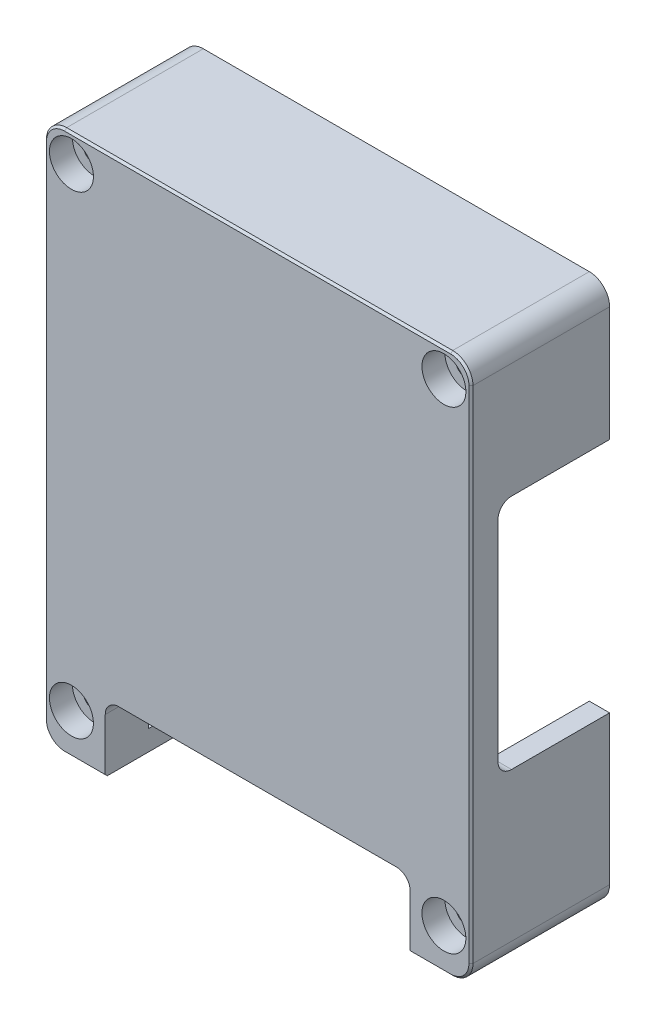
ISO-10303-21;
HEADER;
FILE_DESCRIPTION(('STEP AP214'),'2;1');
FILE_NAME('part.step','',(''),(''),'','','');
FILE_SCHEMA(('AUTOMOTIVE_DESIGN { 1 0 10303 214 1 1 1 1 }'));
ENDSEC;
DATA;
#1=APPLICATION_CONTEXT('core data for automotive mechanical design processes');
#2=APPLICATION_PROTOCOL_DEFINITION('international standard','automotive_design',2000,#1);
#3=PRODUCT_CONTEXT('',#1,'mechanical');
#4=PRODUCT('Part','Part','',(#3));
#5=PRODUCT_RELATED_PRODUCT_CATEGORY('part','',(#4));
#6=PRODUCT_DEFINITION_FORMATION('','',#4);
#7=PRODUCT_DEFINITION_CONTEXT('part definition',#1,'design');
#8=PRODUCT_DEFINITION('design','',#6,#7);
#9=PRODUCT_DEFINITION_SHAPE('','',#8);
#10=(LENGTH_UNIT() NAMED_UNIT(*) SI_UNIT(.MILLI.,.METRE.));
#11=(NAMED_UNIT(*) PLANE_ANGLE_UNIT() SI_UNIT($,.RADIAN.));
#12=(NAMED_UNIT(*) SI_UNIT($,.STERADIAN.) SOLID_ANGLE_UNIT());
#13=UNCERTAINTY_MEASURE_WITH_UNIT(LENGTH_MEASURE(1.E-05),#10,'distance_accuracy_value','');
#14=(GEOMETRIC_REPRESENTATION_CONTEXT(3) GLOBAL_UNCERTAINTY_ASSIGNED_CONTEXT((#13)) GLOBAL_UNIT_ASSIGNED_CONTEXT((#10,
#11,#12)) REPRESENTATION_CONTEXT('',''));
#15=CARTESIAN_POINT('',(0.,0.,0.));
#16=DIRECTION('',(0.,0.,1.));
#17=DIRECTION('',(1.,0.,0.));
#18=AXIS2_PLACEMENT_3D('',#15,#16,#17);
#19=CARTESIAN_POINT('',(0.,0.,0.));
#20=DIRECTION('',(0.,0.,-1.));
#21=DIRECTION('',(-1.,0.,0.));
#22=AXIS2_PLACEMENT_3D('',#19,#20,#21);
#23=PLANE('',#22);
#24=DIRECTION('',(1.,0.,0.));
#25=VECTOR('',#24,1.);
#26=CARTESIAN_POINT('',(-31.5375,-40.,0.));
#27=LINE('',#26,#25);
#28=CARTESIAN_POINT('',(-28.5375,-40.,0.));
#29=VERTEX_POINT('',#28);
#30=CARTESIAN_POINT('',(-22.5375,-40.,0.));
#31=VERTEX_POINT('',#30);
#32=EDGE_CURVE('E365',#29,#31,#27,.T.);
#33=ORIENTED_EDGE('',*,*,#32,.F.);
#34=CARTESIAN_POINT('',(-28.5375,-37.,0.));
#35=DIRECTION('',(0.,0.,-1.));
#36=DIRECTION('',(-1.,0.,0.));
#37=AXIS2_PLACEMENT_3D('',#34,#35,#36);
#38=CIRCLE('',#37,3.);
#39=CARTESIAN_POINT('',(-31.5375,-37.,0.));
#40=VERTEX_POINT('',#39);
#41=EDGE_CURVE('E624',#29,#40,#38,.T.);
#42=ORIENTED_EDGE('',*,*,#41,.T.);
#43=DIRECTION('',(0.,-1.,0.));
#44=VECTOR('',#43,1.);
#45=CARTESIAN_POINT('',(-31.5375,-40.,0.));
#46=LINE('',#45,#44);
#47=CARTESIAN_POINT('',(-31.5375,-15.,0.));
#48=VERTEX_POINT('',#47);
#49=EDGE_CURVE('E610',#48,#40,#46,.T.);
#50=ORIENTED_EDGE('',*,*,#49,.F.);
#51=DIRECTION('',(1.,0.,0.));
#52=VECTOR('',#51,1.);
#53=CARTESIAN_POINT('',(-31.5375,-15.,0.));
#54=LINE('',#53,#52);
#55=CARTESIAN_POINT('',(-28.5375,-15.,0.));
#56=VERTEX_POINT('',#55);
#57=EDGE_CURVE('E415',#48,#56,#54,.T.);
#58=ORIENTED_EDGE('',*,*,#57,.T.);
#59=DIRECTION('',(0.,-1.,0.));
#60=VECTOR('',#59,1.);
#61=CARTESIAN_POINT('',(-28.5375,0.,0.));
#62=LINE('',#61,#60);
#63=CARTESIAN_POINT('',(-28.5375,-29.407614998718,0.));
#64=VERTEX_POINT('',#63);
#65=EDGE_CURVE('E485',#56,#64,#62,.T.);
#66=ORIENTED_EDGE('',*,*,#65,.T.);
#67=CARTESIAN_POINT('',(-27.5375,-34.,0.));
#68=DIRECTION('',(0.,0.,-1.));
#69=DIRECTION('',(-1.,0.,0.));
#70=AXIS2_PLACEMENT_3D('',#67,#68,#69);
#71=CIRCLE('',#70,4.7);
#72=CARTESIAN_POINT('',(-23.9194894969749,-37.,0.));
#73=VERTEX_POINT('',#72);
#74=EDGE_CURVE('E455',#73,#64,#71,.F.);
#75=ORIENTED_EDGE('',*,*,#74,.F.);
#76=DIRECTION('',(1.,0.,0.));
#77=VECTOR('',#76,1.);
#78=CARTESIAN_POINT('',(0.,-37.,0.));
#79=LINE('',#78,#77);
#80=CARTESIAN_POINT('',(-22.5375,-37.,0.));
#81=VERTEX_POINT('',#80);
#82=EDGE_CURVE('E378',#73,#81,#79,.T.);
#83=ORIENTED_EDGE('',*,*,#82,.T.);
#84=DIRECTION('',(0.,-1.,0.));
#85=VECTOR('',#84,1.);
#86=CARTESIAN_POINT('',(-22.5375,-30.,0.));
#87=LINE('',#86,#85);
#88=EDGE_CURVE('E356',#81,#31,#87,.T.);
#89=ORIENTED_EDGE('',*,*,#88,.T.);
#90=EDGE_LOOP('',(#33,#42,#50,#58,#66,#75,#83,#89));
#91=FACE_BOUND('',#90,.T.);
#92=CARTESIAN_POINT('',(-27.5375,-34.,0.));
#93=DIRECTION('',(0.,0.,1.));
#94=DIRECTION('',(1.,0.,0.));
#95=AXIS2_PLACEMENT_3D('',#92,#93,#94);
#96=CIRCLE('',#95,1.69999999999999);
#97=CARTESIAN_POINT('',(-25.8375,-34.,0.));
#98=VERTEX_POINT('',#97);
#99=EDGE_CURVE('E588',#98,#98,#96,.T.);
#100=ORIENTED_EDGE('',*,*,#99,.T.);
#101=EDGE_LOOP('',(#100));
#102=FACE_BOUND('',#101,.T.);
#103=ADVANCED_FACE('F39',(#91,#102),#23,.T.);
#104=CARTESIAN_POINT('',(-31.5375,-40.,20.5));
#105=DIRECTION('',(0.,1.,0.));
#106=DIRECTION('',(0.,0.,1.));
#107=AXIS2_PLACEMENT_3D('',#104,#105,#106);
#108=PLANE('',#107);
#109=DIRECTION('',(0.,0.,-1.));
#110=VECTOR('',#109,1.);
#111=CARTESIAN_POINT('',(-22.5375,-40.,0.));
#112=LINE('',#111,#110);
#113=CARTESIAN_POINT('',(-22.5375,-40.,20.2));
#114=VERTEX_POINT('',#113);
#115=EDGE_CURVE('E351',#114,#31,#112,.T.);
#116=ORIENTED_EDGE('',*,*,#115,.F.);
#117=DIRECTION('',(-1.,0.,0.));
#118=VECTOR('',#117,1.);
#119=CARTESIAN_POINT('',(-31.5375,-40.,20.2));
#120=LINE('',#119,#118);
#121=CARTESIAN_POINT('',(-28.5375,-40.,20.2));
#122=VERTEX_POINT('',#121);
#123=EDGE_CURVE('E739',#114,#122,#120,.T.);
#124=ORIENTED_EDGE('',*,*,#123,.T.);
#125=DIRECTION('',(0.,0.,-1.));
#126=VECTOR('',#125,1.);
#127=CARTESIAN_POINT('',(-28.5375,-40.,20.5));
#128=LINE('',#127,#126);
#129=EDGE_CURVE('E368',#122,#29,#128,.T.);
#130=ORIENTED_EDGE('',*,*,#129,.T.);
#131=ORIENTED_EDGE('',*,*,#32,.T.);
#132=EDGE_LOOP('',(#116,#124,#130,#131));
#133=FACE_BOUND('',#132,.T.);
#134=ADVANCED_FACE('F366',(#133),#108,.F.);
#135=CARTESIAN_POINT('',(-31.5375,-37.,20.5));
#136=DIRECTION('',(0.,1.,0.));
#137=DIRECTION('',(0.,0.,1.));
#138=AXIS2_PLACEMENT_3D('',#135,#136,#137);
#139=PLANE('',#138);
#140=DIRECTION('',(0.,0.,1.));
#141=VECTOR('',#140,1.);
#142=CARTESIAN_POINT('',(-22.5375,-37.,20.5));
#143=LINE('',#142,#141);
#144=CARTESIAN_POINT('',(-22.5375,-37.,14.1));
#145=VERTEX_POINT('',#144);
#146=EDGE_CURVE('E391',#81,#145,#143,.T.);
#147=ORIENTED_EDGE('',*,*,#146,.F.);
#148=ORIENTED_EDGE('',*,*,#82,.F.);
#149=DIRECTION('',(0.,0.,1.));
#150=VECTOR('',#149,1.);
#151=CARTESIAN_POINT('',(-23.9194894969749,-37.,20.5));
#152=LINE('',#151,#150);
#153=CARTESIAN_POINT('',(-23.9194894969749,-37.,14.1));
#154=VERTEX_POINT('',#153);
#155=EDGE_CURVE('E504',#73,#154,#152,.T.);
#156=ORIENTED_EDGE('',*,*,#155,.T.);
#157=DIRECTION('',(1.,0.,0.));
#158=VECTOR('',#157,1.);
#159=CARTESIAN_POINT('',(-25.8375,-37.,14.1));
#160=LINE('',#159,#158);
#161=EDGE_CURVE('E548',#154,#145,#160,.T.);
#162=ORIENTED_EDGE('',*,*,#161,.T.);
#163=EDGE_LOOP('',(#147,#148,#156,#162));
#164=FACE_BOUND('',#163,.T.);
#165=ADVANCED_FACE('F914',(#164),#139,.T.);
#166=DIRECTION('',(0.,1.,0.));
#167=VECTOR('',#166,1.);
#168=CARTESIAN_POINT('',(31.5375,-40.,0.));
#169=LINE('',#168,#167);
#170=CARTESIAN_POINT('',(31.5375,-37.,0.));
#171=VERTEX_POINT('',#170);
#172=CARTESIAN_POINT('',(31.5375,-15.,0.));
#173=VERTEX_POINT('',#172);
#174=EDGE_CURVE('E604',#171,#173,#169,.T.);
#175=ORIENTED_EDGE('',*,*,#174,.F.);
#176=CARTESIAN_POINT('',(28.5375,-37.,0.));
#177=DIRECTION('',(0.,0.,-1.));
#178=DIRECTION('',(-1.,0.,0.));
#179=AXIS2_PLACEMENT_3D('',#176,#177,#178);
#180=CIRCLE('',#179,3.);
#181=CARTESIAN_POINT('',(28.5375,-40.,0.));
#182=VERTEX_POINT('',#181);
#183=EDGE_CURVE('E636',#171,#182,#180,.T.);
#184=ORIENTED_EDGE('',*,*,#183,.T.);
#185=CARTESIAN_POINT('',(22.5375,-40.,0.));
#186=VERTEX_POINT('',#185);
#187=EDGE_CURVE('E372',#186,#182,#27,.T.);
#188=ORIENTED_EDGE('',*,*,#187,.F.);
#189=DIRECTION('',(0.,-1.,0.));
#190=VECTOR('',#189,1.);
#191=CARTESIAN_POINT('',(22.5375,-30.,0.));
#192=LINE('',#191,#190);
#193=CARTESIAN_POINT('',(22.5375,-37.,0.));
#194=VERTEX_POINT('',#193);
#195=EDGE_CURVE('E379',#194,#186,#192,.T.);
#196=ORIENTED_EDGE('',*,*,#195,.F.);
#197=CARTESIAN_POINT('',(23.9194894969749,-37.,0.));
#198=VERTEX_POINT('',#197);
#199=EDGE_CURVE('E481',#194,#198,#79,.T.);
#200=ORIENTED_EDGE('',*,*,#199,.T.);
#201=CARTESIAN_POINT('',(27.5375,-34.,0.));
#202=DIRECTION('',(0.,0.,-1.));
#203=DIRECTION('',(-1.,0.,0.));
#204=AXIS2_PLACEMENT_3D('',#201,#202,#203);
#205=CIRCLE('',#204,4.7);
#206=CARTESIAN_POINT('',(28.5375,-29.407614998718,0.));
#207=VERTEX_POINT('',#206);
#208=EDGE_CURVE('E460',#207,#198,#205,.F.);
#209=ORIENTED_EDGE('',*,*,#208,.F.);
#210=DIRECTION('',(0.,1.,0.));
#211=VECTOR('',#210,1.);
#212=CARTESIAN_POINT('',(28.5375,0.,0.));
#213=LINE('',#212,#211);
#214=CARTESIAN_POINT('',(28.5375,-15.,0.));
#215=VERTEX_POINT('',#214);
#216=EDGE_CURVE('E475',#207,#215,#213,.T.);
#217=ORIENTED_EDGE('',*,*,#216,.T.);
#218=EDGE_CURVE('E419',#215,#173,#54,.T.);
#219=ORIENTED_EDGE('',*,*,#218,.T.);
#220=EDGE_LOOP('',(#175,#184,#188,#196,#200,#209,#217,#219));
#221=FACE_BOUND('',#220,.T.);
#222=CARTESIAN_POINT('',(27.5375,-34.,0.));
#223=DIRECTION('',(0.,0.,1.));
#224=DIRECTION('',(1.,0.,0.));
#225=AXIS2_PLACEMENT_3D('',#222,#223,#224);
#226=CIRCLE('',#225,1.69999999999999);
#227=CARTESIAN_POINT('',(29.2375,-34.,0.));
#228=VERTEX_POINT('',#227);
#229=EDGE_CURVE('E600',#228,#228,#226,.T.);
#230=ORIENTED_EDGE('',*,*,#229,.T.);
#231=EDGE_LOOP('',(#230));
#232=FACE_BOUND('',#231,.T.);
#233=ADVANCED_FACE('F829',(#221,#232),#23,.T.);
#234=CARTESIAN_POINT('',(31.5375,-40.,20.5));
#235=DIRECTION('',(-1.,0.,0.));
#236=DIRECTION('',(0.,0.,1.));
#237=AXIS2_PLACEMENT_3D('',#234,#235,#236);
#238=PLANE('',#237);
#239=DIRECTION('',(0.,0.,-1.));
#240=VECTOR('',#239,1.);
#241=CARTESIAN_POINT('',(31.5375,37.,20.5));
#242=LINE('',#241,#240);
#243=CARTESIAN_POINT('',(31.5375,37.,0.));
#244=VERTEX_POINT('',#243);
#245=CARTESIAN_POINT('',(31.5375,37.,20.2));
#246=VERTEX_POINT('',#245);
#247=EDGE_CURVE('E631',#244,#246,#242,.F.);
#248=ORIENTED_EDGE('',*,*,#247,.T.);
#249=DIRECTION('',(0.,-1.,0.));
#250=VECTOR('',#249,1.);
#251=CARTESIAN_POINT('',(31.5375,-40.,20.2));
#252=LINE('',#251,#250);
#253=CARTESIAN_POINT('',(31.5375,-37.,20.2));
#254=VERTEX_POINT('',#253);
#255=EDGE_CURVE('E745',#246,#254,#252,.T.);
#256=ORIENTED_EDGE('',*,*,#255,.T.);
#257=DIRECTION('',(0.,0.,-1.));
#258=VECTOR('',#257,1.);
#259=CARTESIAN_POINT('',(31.5375,-37.,20.5));
#260=LINE('',#259,#258);
#261=EDGE_CURVE('E634',#254,#171,#260,.T.);
#262=ORIENTED_EDGE('',*,*,#261,.T.);
#263=ORIENTED_EDGE('',*,*,#174,.T.);
#264=DIRECTION('',(0.,0.,-1.));
#265=VECTOR('',#264,1.);
#266=CARTESIAN_POINT('',(31.5375,-15.,0.));
#267=LINE('',#266,#265);
#268=CARTESIAN_POINT('',(31.5375,-15.,14.5));
#269=VERTEX_POINT('',#268);
#270=EDGE_CURVE('E403',#269,#173,#267,.T.);
#271=ORIENTED_EDGE('',*,*,#270,.F.);
#272=CARTESIAN_POINT('',(31.5375,-13.,14.5));
#273=DIRECTION('',(-1.,0.,0.));
#274=DIRECTION('',(0.,0.,1.));
#275=AXIS2_PLACEMENT_3D('',#272,#273,#274);
#276=CIRCLE('',#275,2.);
#277=CARTESIAN_POINT('',(31.5375,-13.,16.5));
#278=VERTEX_POINT('',#277);
#279=EDGE_CURVE('E687',#269,#278,#276,.T.);
#280=ORIENTED_EDGE('',*,*,#279,.T.);
#281=DIRECTION('',(0.,-1.,0.));
#282=VECTOR('',#281,1.);
#283=CARTESIAN_POINT('',(31.5375,20.,16.5));
#284=LINE('',#283,#282);
#285=CARTESIAN_POINT('',(31.5375,18.,16.5));
#286=VERTEX_POINT('',#285);
#287=EDGE_CURVE('E411',#286,#278,#284,.T.);
#288=ORIENTED_EDGE('',*,*,#287,.F.);
#289=CARTESIAN_POINT('',(31.5375,18.,14.5));
#290=DIRECTION('',(-1.,0.,0.));
#291=DIRECTION('',(0.,0.,1.));
#292=AXIS2_PLACEMENT_3D('',#289,#290,#291);
#293=CIRCLE('',#292,2.);
#294=CARTESIAN_POINT('',(31.5375,20.,14.5));
#295=VERTEX_POINT('',#294);
#296=EDGE_CURVE('E691',#286,#295,#293,.T.);
#297=ORIENTED_EDGE('',*,*,#296,.T.);
#298=DIRECTION('',(0.,0.,1.));
#299=VECTOR('',#298,1.);
#300=CARTESIAN_POINT('',(31.5375,20.,0.));
#301=LINE('',#300,#299);
#302=CARTESIAN_POINT('',(31.5375,20.,0.));
#303=VERTEX_POINT('',#302);
#304=EDGE_CURVE('E398',#303,#295,#301,.T.);
#305=ORIENTED_EDGE('',*,*,#304,.F.);
#306=EDGE_CURVE('E603',#303,#244,#169,.T.);
#307=ORIENTED_EDGE('',*,*,#306,.T.);
#308=EDGE_LOOP('',(#248,#256,#262,#263,#271,#280,#288,#297,#305,#307));
#309=FACE_BOUND('',#308,.T.);
#310=ADVANCED_FACE('F918',(#309),#238,.F.);
#311=CARTESIAN_POINT('',(-31.5375,40.,20.5));
#312=DIRECTION('',(0.,-1.,0.));
#313=DIRECTION('',(0.,0.,-1.));
#314=AXIS2_PLACEMENT_3D('',#311,#312,#313);
#315=PLANE('',#314);
#316=DIRECTION('',(0.,0.,-1.));
#317=VECTOR('',#316,1.);
#318=CARTESIAN_POINT('',(-28.5375,40.,20.5));
#319=LINE('',#318,#317);
#320=CARTESIAN_POINT('',(-28.5375,40.,0.));
#321=VERTEX_POINT('',#320);
#322=CARTESIAN_POINT('',(-28.5375,40.,20.2));
#323=VERTEX_POINT('',#322);
#324=EDGE_CURVE('E647',#321,#323,#319,.F.);
#325=ORIENTED_EDGE('',*,*,#324,.T.);
#326=DIRECTION('',(1.,0.,0.));
#327=VECTOR('',#326,1.);
#328=CARTESIAN_POINT('',(-31.5375,40.,20.2));
#329=LINE('',#328,#327);
#330=CARTESIAN_POINT('',(28.5375,40.,20.2));
#331=VERTEX_POINT('',#330);
#332=EDGE_CURVE('E11',#323,#331,#329,.T.);
#333=ORIENTED_EDGE('',*,*,#332,.T.);
#334=DIRECTION('',(0.,0.,-1.));
#335=VECTOR('',#334,1.);
#336=CARTESIAN_POINT('',(28.5375,40.,20.5));
#337=LINE('',#336,#335);
#338=CARTESIAN_POINT('',(28.5375,40.,0.));
#339=VERTEX_POINT('',#338);
#340=EDGE_CURVE('E645',#331,#339,#337,.T.);
#341=ORIENTED_EDGE('',*,*,#340,.T.);
#342=DIRECTION('',(-1.,0.,0.));
#343=VECTOR('',#342,1.);
#344=CARTESIAN_POINT('',(-31.5375,40.,0.));
#345=LINE('',#344,#343);
#346=EDGE_CURVE('E607',#339,#321,#345,.T.);
#347=ORIENTED_EDGE('',*,*,#346,.T.);
#348=EDGE_LOOP('',(#325,#333,#341,#347));
#349=FACE_BOUND('',#348,.T.);
#350=ADVANCED_FACE('F1142',(#349),#315,.F.);
#351=CARTESIAN_POINT('',(-31.5375,-40.,20.5));
#352=DIRECTION('',(1.,0.,0.));
#353=DIRECTION('',(0.,0.,-1.));
#354=AXIS2_PLACEMENT_3D('',#351,#352,#353);
#355=PLANE('',#354);
#356=DIRECTION('',(0.,0.,-1.));
#357=VECTOR('',#356,1.);
#358=CARTESIAN_POINT('',(-31.5375,-37.,20.5));
#359=LINE('',#358,#357);
#360=CARTESIAN_POINT('',(-31.5375,-37.,20.2));
#361=VERTEX_POINT('',#360);
#362=EDGE_CURVE('E628',#40,#361,#359,.F.);
#363=ORIENTED_EDGE('',*,*,#362,.T.);
#364=DIRECTION('',(0.,1.,0.));
#365=VECTOR('',#364,1.);
#366=CARTESIAN_POINT('',(-31.5375,-40.,20.2));
#367=LINE('',#366,#365);
#368=CARTESIAN_POINT('',(-31.5375,37.,20.2));
#369=VERTEX_POINT('',#368);
#370=EDGE_CURVE('E747',#361,#369,#367,.T.);
#371=ORIENTED_EDGE('',*,*,#370,.T.);
#372=DIRECTION('',(0.,0.,-1.));
#373=VECTOR('',#372,1.);
#374=CARTESIAN_POINT('',(-31.5375,37.,20.5));
#375=LINE('',#374,#373);
#376=CARTESIAN_POINT('',(-31.5375,37.,0.));
#377=VERTEX_POINT('',#376);
#378=EDGE_CURVE('E626',#369,#377,#375,.T.);
#379=ORIENTED_EDGE('',*,*,#378,.T.);
#380=CARTESIAN_POINT('',(-31.5375,20.,0.));
#381=VERTEX_POINT('',#380);
#382=EDGE_CURVE('E611',#377,#381,#46,.T.);
#383=ORIENTED_EDGE('',*,*,#382,.T.);
#384=DIRECTION('',(0.,0.,1.));
#385=VECTOR('',#384,1.);
#386=CARTESIAN_POINT('',(-31.5375,20.,0.));
#387=LINE('',#386,#385);
#388=CARTESIAN_POINT('',(-31.5375,20.,14.5));
#389=VERTEX_POINT('',#388);
#390=EDGE_CURVE('E399',#381,#389,#387,.T.);
#391=ORIENTED_EDGE('',*,*,#390,.T.);
#392=CARTESIAN_POINT('',(-31.5375,18.,14.5));
#393=DIRECTION('',(1.,0.,0.));
#394=DIRECTION('',(0.,0.,-1.));
#395=AXIS2_PLACEMENT_3D('',#392,#393,#394);
#396=CIRCLE('',#395,2.);
#397=CARTESIAN_POINT('',(-31.5375,18.,16.5));
#398=VERTEX_POINT('',#397);
#399=EDGE_CURVE('E681',#389,#398,#396,.T.);
#400=ORIENTED_EDGE('',*,*,#399,.T.);
#401=DIRECTION('',(0.,-1.,0.));
#402=VECTOR('',#401,1.);
#403=CARTESIAN_POINT('',(-31.5375,20.,16.5));
#404=LINE('',#403,#402);
#405=CARTESIAN_POINT('',(-31.5375,-13.,16.5));
#406=VERTEX_POINT('',#405);
#407=EDGE_CURVE('E402',#398,#406,#404,.T.);
#408=ORIENTED_EDGE('',*,*,#407,.T.);
#409=CARTESIAN_POINT('',(-31.5375,-13.,14.5));
#410=DIRECTION('',(1.,0.,0.));
#411=DIRECTION('',(0.,0.,-1.));
#412=AXIS2_PLACEMENT_3D('',#409,#410,#411);
#413=CIRCLE('',#412,2.);
#414=CARTESIAN_POINT('',(-31.5375,-15.,14.5));
#415=VERTEX_POINT('',#414);
#416=EDGE_CURVE('E685',#406,#415,#413,.T.);
#417=ORIENTED_EDGE('',*,*,#416,.T.);
#418=DIRECTION('',(0.,0.,-1.));
#419=VECTOR('',#418,1.);
#420=CARTESIAN_POINT('',(-31.5375,-15.,0.));
#421=LINE('',#420,#419);
#422=EDGE_CURVE('E406',#415,#48,#421,.T.);
#423=ORIENTED_EDGE('',*,*,#422,.T.);
#424=ORIENTED_EDGE('',*,*,#49,.T.);
#425=EDGE_LOOP('',(#363,#371,#379,#383,#391,#400,#408,#417,#423,#424));
#426=FACE_BOUND('',#425,.T.);
#427=ADVANCED_FACE('F860',(#426),#355,.F.);
#428=DIRECTION('',(0.,0.,-1.));
#429=VECTOR('',#428,1.);
#430=CARTESIAN_POINT('',(28.5375,-40.,20.5));
#431=LINE('',#430,#429);
#432=CARTESIAN_POINT('',(28.5375,-40.,20.2));
#433=VERTEX_POINT('',#432);
#434=EDGE_CURVE('E638',#182,#433,#431,.F.);
#435=ORIENTED_EDGE('',*,*,#434,.T.);
#436=DIRECTION('',(-1.,0.,0.));
#437=VECTOR('',#436,1.);
#438=CARTESIAN_POINT('',(-31.5375,-40.,20.2));
#439=LINE('',#438,#437);
#440=CARTESIAN_POINT('',(22.5375,-40.,20.2));
#441=VERTEX_POINT('',#440);
#442=EDGE_CURVE('E734',#433,#441,#439,.T.);
#443=ORIENTED_EDGE('',*,*,#442,.T.);
#444=DIRECTION('',(0.,0.,1.));
#445=VECTOR('',#444,1.);
#446=CARTESIAN_POINT('',(22.5375,-40.,0.));
#447=LINE('',#446,#445);
#448=EDGE_CURVE('E362',#186,#441,#447,.T.);
#449=ORIENTED_EDGE('',*,*,#448,.F.);
#450=ORIENTED_EDGE('',*,*,#187,.T.);
#451=EDGE_LOOP('',(#435,#443,#449,#450));
#452=FACE_BOUND('',#451,.T.);
#453=ADVANCED_FACE('F833',(#452),#108,.F.);
#454=CARTESIAN_POINT('',(0.,0.,20.5));
#455=DIRECTION('',(0.,0.,-1.));
#456=DIRECTION('',(-1.,0.,0.));
#457=AXIS2_PLACEMENT_3D('',#454,#455,#456);
#458=PLANE('',#457);
#459=DIRECTION('',(0.,-1.,0.));
#460=VECTOR('',#459,1.);
#461=CARTESIAN_POINT('',(22.5375,-30.,20.5));
#462=LINE('',#461,#460);
#463=CARTESIAN_POINT('',(22.5375,-32.,20.5));
#464=VERTEX_POINT('',#463);
#465=CARTESIAN_POINT('',(22.5375,-39.7,20.5));
#466=VERTEX_POINT('',#465);
#467=EDGE_CURVE('E382',#464,#466,#462,.T.);
#468=ORIENTED_EDGE('',*,*,#467,.T.);
#469=DIRECTION('',(1.,0.,0.));
#470=VECTOR('',#469,1.);
#471=CARTESIAN_POINT('',(0.,-39.7,20.5));
#472=LINE('',#471,#470);
#473=CARTESIAN_POINT('',(28.5375,-39.7,20.5));
#474=VERTEX_POINT('',#473);
#475=EDGE_CURVE('E731',#466,#474,#472,.T.);
#476=ORIENTED_EDGE('',*,*,#475,.T.);
#477=CARTESIAN_POINT('',(28.5375,-37.,20.5));
#478=DIRECTION('',(0.,0.,-1.));
#479=DIRECTION('',(-1.,0.,0.));
#480=AXIS2_PLACEMENT_3D('',#477,#478,#479);
#481=CIRCLE('',#480,2.69999999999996);
#482=CARTESIAN_POINT('',(31.2375,-37.,20.5));
#483=VERTEX_POINT('',#482);
#484=EDGE_CURVE('E727',#474,#483,#481,.F.);
#485=ORIENTED_EDGE('',*,*,#484,.T.);
#486=DIRECTION('',(0.,1.,0.));
#487=VECTOR('',#486,1.);
#488=CARTESIAN_POINT('',(31.2375,0.,20.5));
#489=LINE('',#488,#487);
#490=CARTESIAN_POINT('',(31.2375,37.,20.5));
#491=VERTEX_POINT('',#490);
#492=EDGE_CURVE('E723',#483,#491,#489,.T.);
#493=ORIENTED_EDGE('',*,*,#492,.T.);
#494=CARTESIAN_POINT('',(28.5375,37.,20.5));
#495=DIRECTION('',(0.,0.,-1.));
#496=DIRECTION('',(-1.,0.,0.));
#497=AXIS2_PLACEMENT_3D('',#494,#495,#496);
#498=CIRCLE('',#497,2.69999999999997);
#499=CARTESIAN_POINT('',(28.5375,39.7,20.5));
#500=VERTEX_POINT('',#499);
#501=EDGE_CURVE('E719',#491,#500,#498,.F.);
#502=ORIENTED_EDGE('',*,*,#501,.T.);
#503=DIRECTION('',(-1.,0.,0.));
#504=VECTOR('',#503,1.);
#505=CARTESIAN_POINT('',(0.,39.7,20.5));
#506=LINE('',#505,#504);
#507=CARTESIAN_POINT('',(-28.5375,39.7,20.5));
#508=VERTEX_POINT('',#507);
#509=EDGE_CURVE('E715',#500,#508,#506,.T.);
#510=ORIENTED_EDGE('',*,*,#509,.T.);
#511=CARTESIAN_POINT('',(-28.5375,37.,20.5));
#512=DIRECTION('',(0.,0.,-1.));
#513=DIRECTION('',(-1.,0.,0.));
#514=AXIS2_PLACEMENT_3D('',#511,#512,#513);
#515=CIRCLE('',#514,2.69999999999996);
#516=CARTESIAN_POINT('',(-31.2375,37.,20.5));
#517=VERTEX_POINT('',#516);
#518=EDGE_CURVE('E717',#508,#517,#515,.F.);
#519=ORIENTED_EDGE('',*,*,#518,.T.);
#520=DIRECTION('',(0.,-1.,0.));
#521=VECTOR('',#520,1.);
#522=CARTESIAN_POINT('',(-31.2375,0.,20.5));
#523=LINE('',#522,#521);
#524=CARTESIAN_POINT('',(-31.2375,-37.,20.5));
#525=VERTEX_POINT('',#524);
#526=EDGE_CURVE('E721',#517,#525,#523,.T.);
#527=ORIENTED_EDGE('',*,*,#526,.T.);
#528=CARTESIAN_POINT('',(-28.5375,-37.,20.5));
#529=DIRECTION('',(0.,0.,-1.));
#530=DIRECTION('',(-1.,0.,0.));
#531=AXIS2_PLACEMENT_3D('',#528,#529,#530);
#532=CIRCLE('',#531,2.69999999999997);
#533=CARTESIAN_POINT('',(-28.5375,-39.7,20.5));
#534=VERTEX_POINT('',#533);
#535=EDGE_CURVE('E725',#525,#534,#532,.F.);
#536=ORIENTED_EDGE('',*,*,#535,.T.);
#537=DIRECTION('',(1.,0.,0.));
#538=VECTOR('',#537,1.);
#539=CARTESIAN_POINT('',(0.,-39.7,20.5));
#540=LINE('',#539,#538);
#541=CARTESIAN_POINT('',(-22.5375,-39.7,20.5));
#542=VERTEX_POINT('',#541);
#543=EDGE_CURVE('E729',#534,#542,#540,.T.);
#544=ORIENTED_EDGE('',*,*,#543,.T.);
#545=DIRECTION('',(0.,-1.,0.));
#546=VECTOR('',#545,1.);
#547=CARTESIAN_POINT('',(-22.5375,-30.,20.5));
#548=LINE('',#547,#546);
#549=CARTESIAN_POINT('',(-22.5375,-32.,20.5));
#550=VERTEX_POINT('',#549);
#551=EDGE_CURVE('E392',#550,#542,#548,.T.);
#552=ORIENTED_EDGE('',*,*,#551,.F.);
#553=CARTESIAN_POINT('',(-20.5375,-32.,20.5));
#554=DIRECTION('',(0.,0.,-1.));
#555=DIRECTION('',(-1.,0.,0.));
#556=AXIS2_PLACEMENT_3D('',#553,#554,#555);
#557=CIRCLE('',#556,2.);
#558=CARTESIAN_POINT('',(-20.5375,-30.,20.5));
#559=VERTEX_POINT('',#558);
#560=EDGE_CURVE('E713',#550,#559,#557,.T.);
#561=ORIENTED_EDGE('',*,*,#560,.T.);
#562=DIRECTION('',(-1.,0.,0.));
#563=VECTOR('',#562,1.);
#564=CARTESIAN_POINT('',(-22.5375,-30.,20.5));
#565=LINE('',#564,#563);
#566=CARTESIAN_POINT('',(20.5375,-30.,20.5));
#567=VERTEX_POINT('',#566);
#568=EDGE_CURVE('E380',#567,#559,#565,.T.);
#569=ORIENTED_EDGE('',*,*,#568,.F.);
#570=CARTESIAN_POINT('',(20.5375,-32.,20.5));
#571=DIRECTION('',(0.,0.,-1.));
#572=DIRECTION('',(-1.,0.,0.));
#573=AXIS2_PLACEMENT_3D('',#570,#571,#572);
#574=CIRCLE('',#573,2.);
#575=EDGE_CURVE('E695',#567,#464,#574,.T.);
#576=ORIENTED_EDGE('',*,*,#575,.T.);
#577=EDGE_LOOP('',(#468,#476,#485,#493,#502,#510,#519,#527,#536,#544,#552,#561,#569,#576));
#578=FACE_BOUND('',#577,.T.);
#579=CARTESIAN_POINT('',(27.5375,36.,20.5));
#580=DIRECTION('',(0.,0.,1.));
#581=DIRECTION('',(1.,0.,0.));
#582=AXIS2_PLACEMENT_3D('',#579,#580,#581);
#583=CIRCLE('',#582,3.25);
#584=CARTESIAN_POINT('',(30.7875,36.,20.5));
#585=VERTEX_POINT('',#584);
#586=EDGE_CURVE('E555',#585,#585,#583,.T.);
#587=ORIENTED_EDGE('',*,*,#586,.F.);
#588=EDGE_LOOP('',(#587));
#589=FACE_BOUND('',#588,.T.);
#590=CARTESIAN_POINT('',(-27.5375,36.,20.5));
#591=DIRECTION('',(0.,0.,1.));
#592=DIRECTION('',(1.,0.,0.));
#593=AXIS2_PLACEMENT_3D('',#590,#591,#592);
#594=CIRCLE('',#593,3.25);
#595=CARTESIAN_POINT('',(-24.2875,36.,20.5));
#596=VERTEX_POINT('',#595);
#597=EDGE_CURVE('E567',#596,#596,#594,.T.);
#598=ORIENTED_EDGE('',*,*,#597,.F.);
#599=EDGE_LOOP('',(#598));
#600=FACE_BOUND('',#599,.T.);
#601=CARTESIAN_POINT('',(-27.5375,-34.,20.5));
#602=DIRECTION('',(0.,0.,1.));
#603=DIRECTION('',(1.,0.,0.));
#604=AXIS2_PLACEMENT_3D('',#601,#602,#603);
#605=CIRCLE('',#604,3.25);
#606=CARTESIAN_POINT('',(-24.2875,-34.,20.5));
#607=VERTEX_POINT('',#606);
#608=EDGE_CURVE('E579',#607,#607,#605,.T.);
#609=ORIENTED_EDGE('',*,*,#608,.F.);
#610=EDGE_LOOP('',(#609));
#611=FACE_BOUND('',#610,.T.);
#612=CARTESIAN_POINT('',(27.5375,-34.,20.5));
#613=DIRECTION('',(0.,0.,1.));
#614=DIRECTION('',(1.,0.,0.));
#615=AXIS2_PLACEMENT_3D('',#612,#613,#614);
#616=CIRCLE('',#615,3.25);
#617=CARTESIAN_POINT('',(30.7875,-34.,20.5));
#618=VERTEX_POINT('',#617);
#619=EDGE_CURVE('E591',#618,#618,#616,.T.);
#620=ORIENTED_EDGE('',*,*,#619,.F.);
#621=EDGE_LOOP('',(#620));
#622=FACE_BOUND('',#621,.T.);
#623=ADVANCED_FACE('F785',(#578,#589,#600,#611,#622),#458,.F.);
#624=ORIENTED_EDGE('',*,*,#382,.F.);
#625=CARTESIAN_POINT('',(-28.5375,37.,0.));
#626=DIRECTION('',(0.,0.,-1.));
#627=DIRECTION('',(-1.,0.,0.));
#628=AXIS2_PLACEMENT_3D('',#625,#626,#627);
#629=CIRCLE('',#628,3.);
#630=EDGE_CURVE('E643',#377,#321,#629,.T.);
#631=ORIENTED_EDGE('',*,*,#630,.T.);
#632=ORIENTED_EDGE('',*,*,#346,.F.);
#633=CARTESIAN_POINT('',(28.5375,37.,0.));
#634=DIRECTION('',(0.,0.,-1.));
#635=DIRECTION('',(-1.,0.,0.));
#636=AXIS2_PLACEMENT_3D('',#633,#634,#635);
#637=CIRCLE('',#636,3.);
#638=EDGE_CURVE('E641',#339,#244,#637,.T.);
#639=ORIENTED_EDGE('',*,*,#638,.T.);
#640=ORIENTED_EDGE('',*,*,#306,.F.);
#641=DIRECTION('',(1.,0.,0.));
#642=VECTOR('',#641,1.);
#643=CARTESIAN_POINT('',(-31.5375,20.,0.));
#644=LINE('',#643,#642);
#645=CARTESIAN_POINT('',(28.5375,20.,0.));
#646=VERTEX_POINT('',#645);
#647=EDGE_CURVE('E408',#646,#303,#644,.T.);
#648=ORIENTED_EDGE('',*,*,#647,.F.);
#649=CARTESIAN_POINT('',(28.5375,31.407614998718,0.));
#650=VERTEX_POINT('',#649);
#651=EDGE_CURVE('E479',#646,#650,#213,.T.);
#652=ORIENTED_EDGE('',*,*,#651,.T.);
#653=CARTESIAN_POINT('',(27.5375,36.,0.));
#654=DIRECTION('',(0.,0.,-1.));
#655=DIRECTION('',(-1.,0.,0.));
#656=AXIS2_PLACEMENT_3D('',#653,#654,#655);
#657=CIRCLE('',#656,4.7);
#658=CARTESIAN_POINT('',(22.945114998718,37.,0.));
#659=VERTEX_POINT('',#658);
#660=EDGE_CURVE('E447',#659,#650,#657,.F.);
#661=ORIENTED_EDGE('',*,*,#660,.F.);
#662=DIRECTION('',(-1.,0.,0.));
#663=VECTOR('',#662,1.);
#664=CARTESIAN_POINT('',(0.,37.,0.));
#665=LINE('',#664,#663);
#666=CARTESIAN_POINT('',(-22.945114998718,37.,0.));
#667=VERTEX_POINT('',#666);
#668=EDGE_CURVE('E478',#659,#667,#665,.T.);
#669=ORIENTED_EDGE('',*,*,#668,.T.);
#670=CARTESIAN_POINT('',(-27.5375,36.,0.));
#671=DIRECTION('',(0.,0.,-1.));
#672=DIRECTION('',(-1.,0.,0.));
#673=AXIS2_PLACEMENT_3D('',#670,#671,#672);
#674=CIRCLE('',#673,4.7);
#675=CARTESIAN_POINT('',(-28.5375,31.407614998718,0.));
#676=VERTEX_POINT('',#675);
#677=EDGE_CURVE('E451',#676,#667,#674,.F.);
#678=ORIENTED_EDGE('',*,*,#677,.F.);
#679=CARTESIAN_POINT('',(-28.5375,20.,0.));
#680=VERTEX_POINT('',#679);
#681=EDGE_CURVE('E482',#676,#680,#62,.T.);
#682=ORIENTED_EDGE('',*,*,#681,.T.);
#683=EDGE_CURVE('E420',#381,#680,#644,.T.);
#684=ORIENTED_EDGE('',*,*,#683,.F.);
#685=EDGE_LOOP('',(#624,#631,#632,#639,#640,#648,#652,#661,#669,#678,#682,#684));
#686=FACE_BOUND('',#685,.T.);
#687=CARTESIAN_POINT('',(27.5375,36.,0.));
#688=DIRECTION('',(0.,0.,1.));
#689=DIRECTION('',(1.,0.,0.));
#690=AXIS2_PLACEMENT_3D('',#687,#688,#689);
#691=CIRCLE('',#690,1.69999999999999);
#692=CARTESIAN_POINT('',(29.2375,36.,0.));
#693=VERTEX_POINT('',#692);
#694=EDGE_CURVE('E564',#693,#693,#691,.T.);
#695=ORIENTED_EDGE('',*,*,#694,.T.);
#696=EDGE_LOOP('',(#695));
#697=FACE_BOUND('',#696,.T.);
#698=CARTESIAN_POINT('',(-27.5375,36.,0.));
#699=DIRECTION('',(0.,0.,1.));
#700=DIRECTION('',(1.,0.,0.));
#701=AXIS2_PLACEMENT_3D('',#698,#699,#700);
#702=CIRCLE('',#701,1.69999999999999);
#703=CARTESIAN_POINT('',(-25.8375,36.,0.));
#704=VERTEX_POINT('',#703);
#705=EDGE_CURVE('E576',#704,#704,#702,.T.);
#706=ORIENTED_EDGE('',*,*,#705,.T.);
#707=EDGE_LOOP('',(#706));
#708=FACE_BOUND('',#707,.T.);
#709=ADVANCED_FACE('F869',(#686,#697,#708),#23,.T.);
#710=CARTESIAN_POINT('',(27.5375,-34.,20.5));
#711=DIRECTION('',(0.,0.,1.));
#712=DIRECTION('',(1.,0.,0.));
#713=AXIS2_PLACEMENT_3D('',#710,#711,#712);
#714=CYLINDRICAL_SURFACE('',#713,1.7);
#715=ORIENTED_EDGE('',*,*,#229,.F.);
#716=EDGE_LOOP('',(#715));
#717=FACE_BOUND('',#716,.T.);
#718=CARTESIAN_POINT('',(27.5375,-34.,17.1));
#719=DIRECTION('',(0.,0.,1.));
#720=DIRECTION('',(1.,0.,0.));
#721=AXIS2_PLACEMENT_3D('',#718,#719,#720);
#722=CIRCLE('',#721,1.7);
#723=CARTESIAN_POINT('',(29.2375,-34.,17.1));
#724=VERTEX_POINT('',#723);
#725=EDGE_CURVE('E597',#724,#724,#722,.T.);
#726=ORIENTED_EDGE('',*,*,#725,.T.);
#727=EDGE_LOOP('',(#726));
#728=FACE_BOUND('',#727,.T.);
#729=ADVANCED_FACE('F920',(#717,#728),#714,.F.);
#730=CARTESIAN_POINT('',(29.2375,-34.,17.1));
#731=DIRECTION('',(0.,0.,-1.));
#732=DIRECTION('',(-1.,0.,0.));
#733=AXIS2_PLACEMENT_3D('',#730,#731,#732);
#734=PLANE('',#733);
#735=ORIENTED_EDGE('',*,*,#725,.F.);
#736=EDGE_LOOP('',(#735));
#737=FACE_BOUND('',#736,.T.);
#738=CARTESIAN_POINT('',(27.5375,-34.,17.1));
#739=DIRECTION('',(0.,0.,1.));
#740=DIRECTION('',(1.,0.,0.));
#741=AXIS2_PLACEMENT_3D('',#738,#739,#740);
#742=CIRCLE('',#741,3.25);
#743=CARTESIAN_POINT('',(30.7875,-34.,17.1));
#744=VERTEX_POINT('',#743);
#745=EDGE_CURVE('E594',#744,#744,#742,.T.);
#746=ORIENTED_EDGE('',*,*,#745,.T.);
#747=EDGE_LOOP('',(#746));
#748=FACE_BOUND('',#747,.T.);
#749=ADVANCED_FACE('F925',(#737,#748),#734,.F.);
#750=CARTESIAN_POINT('',(27.5375,-34.,20.5));
#751=DIRECTION('',(0.,0.,1.));
#752=DIRECTION('',(1.,0.,0.));
#753=AXIS2_PLACEMENT_3D('',#750,#751,#752);
#754=CYLINDRICAL_SURFACE('',#753,3.25);
#755=ORIENTED_EDGE('',*,*,#745,.F.);
#756=EDGE_LOOP('',(#755));
#757=FACE_BOUND('',#756,.T.);
#758=ORIENTED_EDGE('',*,*,#619,.T.);
#759=EDGE_LOOP('',(#758));
#760=FACE_BOUND('',#759,.T.);
#761=ADVANCED_FACE('F934',(#757,#760),#754,.F.);
#762=CARTESIAN_POINT('',(-27.5375,-34.,20.5));
#763=DIRECTION('',(0.,0.,1.));
#764=DIRECTION('',(1.,0.,0.));
#765=AXIS2_PLACEMENT_3D('',#762,#763,#764);
#766=CYLINDRICAL_SURFACE('',#765,1.7);
#767=ORIENTED_EDGE('',*,*,#99,.F.);
#768=EDGE_LOOP('',(#767));
#769=FACE_BOUND('',#768,.T.);
#770=CARTESIAN_POINT('',(-27.5375,-34.,17.1));
#771=DIRECTION('',(0.,0.,1.));
#772=DIRECTION('',(1.,0.,0.));
#773=AXIS2_PLACEMENT_3D('',#770,#771,#772);
#774=CIRCLE('',#773,1.7);
#775=CARTESIAN_POINT('',(-25.8375,-34.,17.1));
#776=VERTEX_POINT('',#775);
#777=EDGE_CURVE('E585',#776,#776,#774,.T.);
#778=ORIENTED_EDGE('',*,*,#777,.T.);
#779=EDGE_LOOP('',(#778));
#780=FACE_BOUND('',#779,.T.);
#781=ADVANCED_FACE('F938',(#769,#780),#766,.F.);
#782=CARTESIAN_POINT('',(-25.8375,-34.,17.1));
#783=DIRECTION('',(0.,0.,-1.));
#784=DIRECTION('',(-1.,0.,0.));
#785=AXIS2_PLACEMENT_3D('',#782,#783,#784);
#786=PLANE('',#785);
#787=ORIENTED_EDGE('',*,*,#777,.F.);
#788=EDGE_LOOP('',(#787));
#789=FACE_BOUND('',#788,.T.);
#790=CARTESIAN_POINT('',(-27.5375,-34.,17.1));
#791=DIRECTION('',(0.,0.,1.));
#792=DIRECTION('',(1.,0.,0.));
#793=AXIS2_PLACEMENT_3D('',#790,#791,#792);
#794=CIRCLE('',#793,3.25);
#795=CARTESIAN_POINT('',(-24.2875,-34.,17.1));
#796=VERTEX_POINT('',#795);
#797=EDGE_CURVE('E582',#796,#796,#794,.T.);
#798=ORIENTED_EDGE('',*,*,#797,.T.);
#799=EDGE_LOOP('',(#798));
#800=FACE_BOUND('',#799,.T.);
#801=ADVANCED_FACE('F942',(#789,#800),#786,.F.);
#802=CARTESIAN_POINT('',(-27.5375,-34.,20.5));
#803=DIRECTION('',(0.,0.,1.));
#804=DIRECTION('',(1.,0.,0.));
#805=AXIS2_PLACEMENT_3D('',#802,#803,#804);
#806=CYLINDRICAL_SURFACE('',#805,3.25);
#807=ORIENTED_EDGE('',*,*,#797,.F.);
#808=EDGE_LOOP('',(#807));
#809=FACE_BOUND('',#808,.T.);
#810=ORIENTED_EDGE('',*,*,#608,.T.);
#811=EDGE_LOOP('',(#810));
#812=FACE_BOUND('',#811,.T.);
#813=ADVANCED_FACE('F946',(#809,#812),#806,.F.);
#814=CARTESIAN_POINT('',(-27.5375,36.,20.5));
#815=DIRECTION('',(0.,0.,1.));
#816=DIRECTION('',(1.,0.,0.));
#817=AXIS2_PLACEMENT_3D('',#814,#815,#816);
#818=CYLINDRICAL_SURFACE('',#817,1.7);
#819=ORIENTED_EDGE('',*,*,#705,.F.);
#820=EDGE_LOOP('',(#819));
#821=FACE_BOUND('',#820,.T.);
#822=CARTESIAN_POINT('',(-27.5375,36.,17.1));
#823=DIRECTION('',(0.,0.,1.));
#824=DIRECTION('',(1.,0.,0.));
#825=AXIS2_PLACEMENT_3D('',#822,#823,#824);
#826=CIRCLE('',#825,1.7);
#827=CARTESIAN_POINT('',(-25.8375,36.,17.1));
#828=VERTEX_POINT('',#827);
#829=EDGE_CURVE('E573',#828,#828,#826,.T.);
#830=ORIENTED_EDGE('',*,*,#829,.T.);
#831=EDGE_LOOP('',(#830));
#832=FACE_BOUND('',#831,.T.);
#833=ADVANCED_FACE('F950',(#821,#832),#818,.F.);
#834=CARTESIAN_POINT('',(-25.8375,36.,17.1));
#835=DIRECTION('',(0.,0.,-1.));
#836=DIRECTION('',(-1.,0.,0.));
#837=AXIS2_PLACEMENT_3D('',#834,#835,#836);
#838=PLANE('',#837);
#839=ORIENTED_EDGE('',*,*,#829,.F.);
#840=EDGE_LOOP('',(#839));
#841=FACE_BOUND('',#840,.T.);
#842=CARTESIAN_POINT('',(-27.5375,36.,17.1));
#843=DIRECTION('',(0.,0.,1.));
#844=DIRECTION('',(1.,0.,0.));
#845=AXIS2_PLACEMENT_3D('',#842,#843,#844);
#846=CIRCLE('',#845,3.25);
#847=CARTESIAN_POINT('',(-24.2875,36.,17.1));
#848=VERTEX_POINT('',#847);
#849=EDGE_CURVE('E570',#848,#848,#846,.T.);
#850=ORIENTED_EDGE('',*,*,#849,.T.);
#851=EDGE_LOOP('',(#850));
#852=FACE_BOUND('',#851,.T.);
#853=ADVANCED_FACE('F954',(#841,#852),#838,.F.);
#854=CARTESIAN_POINT('',(-27.5375,36.,20.5));
#855=DIRECTION('',(0.,0.,1.));
#856=DIRECTION('',(1.,0.,0.));
#857=AXIS2_PLACEMENT_3D('',#854,#855,#856);
#858=CYLINDRICAL_SURFACE('',#857,3.25);
#859=ORIENTED_EDGE('',*,*,#849,.F.);
#860=EDGE_LOOP('',(#859));
#861=FACE_BOUND('',#860,.T.);
#862=ORIENTED_EDGE('',*,*,#597,.T.);
#863=EDGE_LOOP('',(#862));
#864=FACE_BOUND('',#863,.T.);
#865=ADVANCED_FACE('F958',(#861,#864),#858,.F.);
#866=CARTESIAN_POINT('',(27.5375,36.,20.5));
#867=DIRECTION('',(0.,0.,1.));
#868=DIRECTION('',(1.,0.,0.));
#869=AXIS2_PLACEMENT_3D('',#866,#867,#868);
#870=CYLINDRICAL_SURFACE('',#869,1.7);
#871=ORIENTED_EDGE('',*,*,#694,.F.);
#872=EDGE_LOOP('',(#871));
#873=FACE_BOUND('',#872,.T.);
#874=CARTESIAN_POINT('',(27.5375,36.,17.1));
#875=DIRECTION('',(0.,0.,1.));
#876=DIRECTION('',(1.,0.,0.));
#877=AXIS2_PLACEMENT_3D('',#874,#875,#876);
#878=CIRCLE('',#877,1.7);
#879=CARTESIAN_POINT('',(29.2375,36.,17.1));
#880=VERTEX_POINT('',#879);
#881=EDGE_CURVE('E561',#880,#880,#878,.T.);
#882=ORIENTED_EDGE('',*,*,#881,.T.);
#883=EDGE_LOOP('',(#882));
#884=FACE_BOUND('',#883,.T.);
#885=ADVANCED_FACE('F962',(#873,#884),#870,.F.);
#886=CARTESIAN_POINT('',(29.2375,36.,17.1));
#887=DIRECTION('',(0.,0.,-1.));
#888=DIRECTION('',(-1.,0.,0.));
#889=AXIS2_PLACEMENT_3D('',#886,#887,#888);
#890=PLANE('',#889);
#891=ORIENTED_EDGE('',*,*,#881,.F.);
#892=EDGE_LOOP('',(#891));
#893=FACE_BOUND('',#892,.T.);
#894=CARTESIAN_POINT('',(27.5375,36.,17.1));
#895=DIRECTION('',(0.,0.,1.));
#896=DIRECTION('',(1.,0.,0.));
#897=AXIS2_PLACEMENT_3D('',#894,#895,#896);
#898=CIRCLE('',#897,3.25);
#899=CARTESIAN_POINT('',(30.7875,36.,17.1));
#900=VERTEX_POINT('',#899);
#901=EDGE_CURVE('E558',#900,#900,#898,.T.);
#902=ORIENTED_EDGE('',*,*,#901,.T.);
#903=EDGE_LOOP('',(#902));
#904=FACE_BOUND('',#903,.T.);
#905=ADVANCED_FACE('F966',(#893,#904),#890,.F.);
#906=CARTESIAN_POINT('',(27.5375,36.,20.5));
#907=DIRECTION('',(0.,0.,1.));
#908=DIRECTION('',(1.,0.,0.));
#909=AXIS2_PLACEMENT_3D('',#906,#907,#908);
#910=CYLINDRICAL_SURFACE('',#909,3.25);
#911=ORIENTED_EDGE('',*,*,#901,.F.);
#912=EDGE_LOOP('',(#911));
#913=FACE_BOUND('',#912,.T.);
#914=ORIENTED_EDGE('',*,*,#586,.T.);
#915=EDGE_LOOP('',(#914));
#916=FACE_BOUND('',#915,.T.);
#917=ADVANCED_FACE('F970',(#913,#916),#910,.F.);
#918=CARTESIAN_POINT('',(-31.5375,37.,20.5));
#919=DIRECTION('',(0.,-1.,0.));
#920=DIRECTION('',(0.,0.,-1.));
#921=AXIS2_PLACEMENT_3D('',#918,#919,#920);
#922=PLANE('',#921);
#923=DIRECTION('',(-1.,0.,0.));
#924=VECTOR('',#923,1.);
#925=CARTESIAN_POINT('',(29.2375,37.,14.1));
#926=LINE('',#925,#924);
#927=CARTESIAN_POINT('',(22.945114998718,37.,14.1));
#928=VERTEX_POINT('',#927);
#929=CARTESIAN_POINT('',(21.3680186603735,37.,14.1));
#930=VERTEX_POINT('',#929);
#931=EDGE_CURVE('E553',#928,#930,#926,.T.);
#932=ORIENTED_EDGE('',*,*,#931,.T.);
#933=DIRECTION('',(0.,0.,1.));
#934=VECTOR('',#933,1.);
#935=CARTESIAN_POINT('',(21.3680186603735,37.,20.5));
#936=LINE('',#935,#934);
#937=CARTESIAN_POINT('',(21.3680186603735,37.,17.5));
#938=VERTEX_POINT('',#937);
#939=EDGE_CURVE('E534',#938,#930,#936,.F.);
#940=ORIENTED_EDGE('',*,*,#939,.F.);
#941=DIRECTION('',(-1.,0.,0.));
#942=VECTOR('',#941,1.);
#943=CARTESIAN_POINT('',(0.,37.,17.5));
#944=LINE('',#943,#942);
#945=CARTESIAN_POINT('',(-21.3680186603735,37.,17.5));
#946=VERTEX_POINT('',#945);
#947=EDGE_CURVE('E433',#938,#946,#944,.T.);
#948=ORIENTED_EDGE('',*,*,#947,.T.);
#949=DIRECTION('',(0.,0.,1.));
#950=VECTOR('',#949,1.);
#951=CARTESIAN_POINT('',(-21.3680186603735,37.,20.5));
#952=LINE('',#951,#950);
#953=CARTESIAN_POINT('',(-21.3680186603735,37.,14.1));
#954=VERTEX_POINT('',#953);
#955=EDGE_CURVE('E525',#946,#954,#952,.F.);
#956=ORIENTED_EDGE('',*,*,#955,.T.);
#957=DIRECTION('',(-1.,0.,0.));
#958=VECTOR('',#957,1.);
#959=CARTESIAN_POINT('',(-25.8375,37.,14.1));
#960=LINE('',#959,#958);
#961=CARTESIAN_POINT('',(-22.945114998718,37.,14.1));
#962=VERTEX_POINT('',#961);
#963=EDGE_CURVE('E551',#954,#962,#960,.T.);
#964=ORIENTED_EDGE('',*,*,#963,.T.);
#965=DIRECTION('',(0.,0.,1.));
#966=VECTOR('',#965,1.);
#967=CARTESIAN_POINT('',(-22.945114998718,37.,20.5));
#968=LINE('',#967,#966);
#969=EDGE_CURVE('E510',#667,#962,#968,.T.);
#970=ORIENTED_EDGE('',*,*,#969,.F.);
#971=ORIENTED_EDGE('',*,*,#668,.F.);
#972=DIRECTION('',(0.,0.,1.));
#973=VECTOR('',#972,1.);
#974=CARTESIAN_POINT('',(22.945114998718,37.,20.5));
#975=LINE('',#974,#973);
#976=EDGE_CURVE('E516',#659,#928,#975,.T.);
#977=ORIENTED_EDGE('',*,*,#976,.T.);
#978=EDGE_LOOP('',(#932,#940,#948,#956,#964,#970,#971,#977));
#979=FACE_BOUND('',#978,.T.);
#980=ADVANCED_FACE('F974',(#979),#922,.T.);
#981=DIRECTION('',(0.,0.,-1.));
#982=VECTOR('',#981,1.);
#983=CARTESIAN_POINT('',(22.5375,-37.,20.5));
#984=LINE('',#983,#982);
#985=CARTESIAN_POINT('',(22.5375,-37.,14.1));
#986=VERTEX_POINT('',#985);
#987=EDGE_CURVE('E396',#986,#194,#984,.T.);
#988=ORIENTED_EDGE('',*,*,#987,.F.);
#989=DIRECTION('',(1.,0.,0.));
#990=VECTOR('',#989,1.);
#991=CARTESIAN_POINT('',(29.2375,-37.,14.1));
#992=LINE('',#991,#990);
#993=CARTESIAN_POINT('',(23.9194894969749,-37.,14.1));
#994=VERTEX_POINT('',#993);
#995=EDGE_CURVE('E541',#986,#994,#992,.T.);
#996=ORIENTED_EDGE('',*,*,#995,.T.);
#997=DIRECTION('',(0.,0.,1.));
#998=VECTOR('',#997,1.);
#999=CARTESIAN_POINT('',(23.9194894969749,-37.,20.5));
#1000=LINE('',#999,#998);
#1001=EDGE_CURVE('E498',#198,#994,#1000,.T.);
#1002=ORIENTED_EDGE('',*,*,#1001,.F.);
#1003=ORIENTED_EDGE('',*,*,#199,.F.);
#1004=EDGE_LOOP('',(#988,#996,#1002,#1003));
#1005=FACE_BOUND('',#1004,.T.);
#1006=ADVANCED_FACE('F824',(#1005),#139,.T.);
#1007=CARTESIAN_POINT('',(28.5375,-40.,20.5));
#1008=DIRECTION('',(-1.,0.,0.));
#1009=DIRECTION('',(0.,0.,1.));
#1010=AXIS2_PLACEMENT_3D('',#1007,#1008,#1009);
#1011=PLANE('',#1010);
#1012=DIRECTION('',(0.,0.,1.));
#1013=VECTOR('',#1012,1.);
#1014=CARTESIAN_POINT('',(28.5375,-15.,20.5));
#1015=LINE('',#1014,#1013);
#1016=CARTESIAN_POINT('',(28.5375,-15.,14.5));
#1017=VERTEX_POINT('',#1016);
#1018=EDGE_CURVE('E426',#215,#1017,#1015,.T.);
#1019=ORIENTED_EDGE('',*,*,#1018,.F.);
#1020=ORIENTED_EDGE('',*,*,#216,.F.);
#1021=DIRECTION('',(0.,0.,1.));
#1022=VECTOR('',#1021,1.);
#1023=CARTESIAN_POINT('',(28.5375,-29.407614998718,20.5));
#1024=LINE('',#1023,#1022);
#1025=CARTESIAN_POINT('',(28.5375,-29.407614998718,14.1));
#1026=VERTEX_POINT('',#1025);
#1027=EDGE_CURVE('E439',#207,#1026,#1024,.T.);
#1028=ORIENTED_EDGE('',*,*,#1027,.T.);
#1029=DIRECTION('',(0.,-1.,0.));
#1030=VECTOR('',#1029,1.);
#1031=CARTESIAN_POINT('',(28.5375,-40.,14.1));
#1032=LINE('',#1031,#1030);
#1033=CARTESIAN_POINT('',(28.5375,-27.8305186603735,14.1));
#1034=VERTEX_POINT('',#1033);
#1035=EDGE_CURVE('E537',#1034,#1026,#1032,.T.);
#1036=ORIENTED_EDGE('',*,*,#1035,.F.);
#1037=DIRECTION('',(0.,0.,1.));
#1038=VECTOR('',#1037,1.);
#1039=CARTESIAN_POINT('',(28.5375,-27.8305186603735,20.5));
#1040=LINE('',#1039,#1038);
#1041=CARTESIAN_POINT('',(28.5375,-27.8305186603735,17.5));
#1042=VERTEX_POINT('',#1041);
#1043=EDGE_CURVE('E519',#1042,#1034,#1040,.F.);
#1044=ORIENTED_EDGE('',*,*,#1043,.F.);
#1045=DIRECTION('',(0.,1.,0.));
#1046=VECTOR('',#1045,1.);
#1047=CARTESIAN_POINT('',(28.5375,0.,17.5));
#1048=LINE('',#1047,#1046);
#1049=CARTESIAN_POINT('',(28.5375,29.8305186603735,17.5));
#1050=VERTEX_POINT('',#1049);
#1051=EDGE_CURVE('E430',#1042,#1050,#1048,.T.);
#1052=ORIENTED_EDGE('',*,*,#1051,.T.);
#1053=DIRECTION('',(0.,0.,1.));
#1054=VECTOR('',#1053,1.);
#1055=CARTESIAN_POINT('',(28.5375,29.8305186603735,20.5));
#1056=LINE('',#1055,#1054);
#1057=CARTESIAN_POINT('',(28.5375,29.8305186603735,14.1));
#1058=VERTEX_POINT('',#1057);
#1059=EDGE_CURVE('E531',#1050,#1058,#1056,.F.);
#1060=ORIENTED_EDGE('',*,*,#1059,.T.);
#1061=DIRECTION('',(0.,-1.,0.));
#1062=VECTOR('',#1061,1.);
#1063=CARTESIAN_POINT('',(28.5375,-40.,14.1));
#1064=LINE('',#1063,#1062);
#1065=CARTESIAN_POINT('',(28.5375,31.407614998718,14.1));
#1066=VERTEX_POINT('',#1065);
#1067=EDGE_CURVE('E539',#1066,#1058,#1064,.T.);
#1068=ORIENTED_EDGE('',*,*,#1067,.F.);
#1069=DIRECTION('',(0.,0.,1.));
#1070=VECTOR('',#1069,1.);
#1071=CARTESIAN_POINT('',(28.5375,31.407614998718,20.5));
#1072=LINE('',#1071,#1070);
#1073=EDGE_CURVE('E513',#650,#1066,#1072,.T.);
#1074=ORIENTED_EDGE('',*,*,#1073,.F.);
#1075=ORIENTED_EDGE('',*,*,#651,.F.);
#1076=DIRECTION('',(0.,0.,-1.));
#1077=VECTOR('',#1076,1.);
#1078=CARTESIAN_POINT('',(28.5375,20.,20.5));
#1079=LINE('',#1078,#1077);
#1080=CARTESIAN_POINT('',(28.5375,20.,14.5));
#1081=VERTEX_POINT('',#1080);
#1082=EDGE_CURVE('E418',#1081,#646,#1079,.T.);
#1083=ORIENTED_EDGE('',*,*,#1082,.F.);
#1084=CARTESIAN_POINT('',(28.5375,18.,14.5));
#1085=DIRECTION('',(-1.,0.,0.));
#1086=DIRECTION('',(0.,0.,1.));
#1087=AXIS2_PLACEMENT_3D('',#1084,#1085,#1086);
#1088=CIRCLE('',#1087,2.);
#1089=CARTESIAN_POINT('',(28.5375,18.,16.5));
#1090=VERTEX_POINT('',#1089);
#1091=EDGE_CURVE('E693',#1081,#1090,#1088,.F.);
#1092=ORIENTED_EDGE('',*,*,#1091,.T.);
#1093=DIRECTION('',(0.,1.,0.));
#1094=VECTOR('',#1093,1.);
#1095=CARTESIAN_POINT('',(28.5375,-40.,16.5));
#1096=LINE('',#1095,#1094);
#1097=CARTESIAN_POINT('',(28.5375,-13.,16.5));
#1098=VERTEX_POINT('',#1097);
#1099=EDGE_CURVE('E423',#1098,#1090,#1096,.T.);
#1100=ORIENTED_EDGE('',*,*,#1099,.F.);
#1101=CARTESIAN_POINT('',(28.5375,-13.,14.5));
#1102=DIRECTION('',(-1.,0.,0.));
#1103=DIRECTION('',(0.,0.,1.));
#1104=AXIS2_PLACEMENT_3D('',#1101,#1102,#1103);
#1105=CIRCLE('',#1104,2.);
#1106=EDGE_CURVE('E689',#1098,#1017,#1105,.F.);
#1107=ORIENTED_EDGE('',*,*,#1106,.T.);
#1108=EDGE_LOOP('',(#1019,#1020,#1028,#1036,#1044,#1052,#1060,#1068,#1074,#1075,#1083,#1092,
#1100,#1107));
#1109=FACE_BOUND('',#1108,.T.);
#1110=ADVANCED_FACE('F1029',(#1109),#1011,.T.);
#1111=CARTESIAN_POINT('',(-28.5375,-40.,20.5));
#1112=DIRECTION('',(1.,0.,0.));
#1113=DIRECTION('',(0.,0.,-1.));
#1114=AXIS2_PLACEMENT_3D('',#1111,#1112,#1113);
#1115=PLANE('',#1114);
#1116=DIRECTION('',(0.,0.,-1.));
#1117=VECTOR('',#1116,1.);
#1118=CARTESIAN_POINT('',(-28.5375,-15.,20.5));
#1119=LINE('',#1118,#1117);
#1120=CARTESIAN_POINT('',(-28.5375,-15.,14.5));
#1121=VERTEX_POINT('',#1120);
#1122=EDGE_CURVE('E618',#1121,#56,#1119,.T.);
#1123=ORIENTED_EDGE('',*,*,#1122,.F.);
#1124=CARTESIAN_POINT('',(-28.5375,-13.,14.5));
#1125=DIRECTION('',(1.,0.,0.));
#1126=DIRECTION('',(0.,0.,-1.));
#1127=AXIS2_PLACEMENT_3D('',#1124,#1125,#1126);
#1128=CIRCLE('',#1127,2.);
#1129=CARTESIAN_POINT('',(-28.5375,-13.,16.5));
#1130=VERTEX_POINT('',#1129);
#1131=EDGE_CURVE('E683',#1121,#1130,#1128,.F.);
#1132=ORIENTED_EDGE('',*,*,#1131,.T.);
#1133=DIRECTION('',(0.,-1.,0.));
#1134=VECTOR('',#1133,1.);
#1135=CARTESIAN_POINT('',(-28.5375,-40.,16.5));
#1136=LINE('',#1135,#1134);
#1137=CARTESIAN_POINT('',(-28.5375,18.,16.5));
#1138=VERTEX_POINT('',#1137);
#1139=EDGE_CURVE('E615',#1138,#1130,#1136,.T.);
#1140=ORIENTED_EDGE('',*,*,#1139,.F.);
#1141=CARTESIAN_POINT('',(-28.5375,18.,14.5));
#1142=DIRECTION('',(1.,0.,0.));
#1143=DIRECTION('',(0.,0.,-1.));
#1144=AXIS2_PLACEMENT_3D('',#1141,#1142,#1143);
#1145=CIRCLE('',#1144,2.);
#1146=CARTESIAN_POINT('',(-28.5375,20.,14.5));
#1147=VERTEX_POINT('',#1146);
#1148=EDGE_CURVE('E679',#1138,#1147,#1145,.F.);
#1149=ORIENTED_EDGE('',*,*,#1148,.T.);
#1150=DIRECTION('',(0.,0.,1.));
#1151=VECTOR('',#1150,1.);
#1152=CARTESIAN_POINT('',(-28.5375,20.,20.5));
#1153=LINE('',#1152,#1151);
#1154=EDGE_CURVE('E371',#680,#1147,#1153,.T.);
#1155=ORIENTED_EDGE('',*,*,#1154,.F.);
#1156=ORIENTED_EDGE('',*,*,#681,.F.);
#1157=DIRECTION('',(0.,0.,1.));
#1158=VECTOR('',#1157,1.);
#1159=CARTESIAN_POINT('',(-28.5375,31.407614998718,20.5));
#1160=LINE('',#1159,#1158);
#1161=CARTESIAN_POINT('',(-28.5375,31.407614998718,14.1));
#1162=VERTEX_POINT('',#1161);
#1163=EDGE_CURVE('E507',#676,#1162,#1160,.T.);
#1164=ORIENTED_EDGE('',*,*,#1163,.T.);
#1165=DIRECTION('',(0.,1.,0.));
#1166=VECTOR('',#1165,1.);
#1167=CARTESIAN_POINT('',(-28.5375,-40.,14.1));
#1168=LINE('',#1167,#1166);
#1169=CARTESIAN_POINT('',(-28.5375,29.8305186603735,14.1));
#1170=VERTEX_POINT('',#1169);
#1171=EDGE_CURVE('E546',#1170,#1162,#1168,.T.);
#1172=ORIENTED_EDGE('',*,*,#1171,.F.);
#1173=DIRECTION('',(0.,0.,1.));
#1174=VECTOR('',#1173,1.);
#1175=CARTESIAN_POINT('',(-28.5375,29.8305186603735,20.5));
#1176=LINE('',#1175,#1174);
#1177=CARTESIAN_POINT('',(-28.5375,29.8305186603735,17.5));
#1178=VERTEX_POINT('',#1177);
#1179=EDGE_CURVE('E528',#1178,#1170,#1176,.F.);
#1180=ORIENTED_EDGE('',*,*,#1179,.F.);
#1181=DIRECTION('',(0.,-1.,0.));
#1182=VECTOR('',#1181,1.);
#1183=CARTESIAN_POINT('',(-28.5375,0.,17.5));
#1184=LINE('',#1183,#1182);
#1185=CARTESIAN_POINT('',(-28.5375,-27.8305186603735,17.5));
#1186=VERTEX_POINT('',#1185);
#1187=EDGE_CURVE('E436',#1178,#1186,#1184,.T.);
#1188=ORIENTED_EDGE('',*,*,#1187,.T.);
#1189=DIRECTION('',(0.,0.,1.));
#1190=VECTOR('',#1189,1.);
#1191=CARTESIAN_POINT('',(-28.5375,-27.8305186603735,20.5));
#1192=LINE('',#1191,#1190);
#1193=CARTESIAN_POINT('',(-28.5375,-27.8305186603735,14.1));
#1194=VERTEX_POINT('',#1193);
#1195=EDGE_CURVE('E522',#1186,#1194,#1192,.F.);
#1196=ORIENTED_EDGE('',*,*,#1195,.T.);
#1197=DIRECTION('',(0.,1.,0.));
#1198=VECTOR('',#1197,1.);
#1199=CARTESIAN_POINT('',(-28.5375,-40.,14.1));
#1200=LINE('',#1199,#1198);
#1201=CARTESIAN_POINT('',(-28.5375,-29.407614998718,14.1));
#1202=VERTEX_POINT('',#1201);
#1203=EDGE_CURVE('E543',#1202,#1194,#1200,.T.);
#1204=ORIENTED_EDGE('',*,*,#1203,.F.);
#1205=DIRECTION('',(0.,0.,1.));
#1206=VECTOR('',#1205,1.);
#1207=CARTESIAN_POINT('',(-28.5375,-29.407614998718,20.5));
#1208=LINE('',#1207,#1206);
#1209=EDGE_CURVE('E501',#64,#1202,#1208,.T.);
#1210=ORIENTED_EDGE('',*,*,#1209,.F.);
#1211=ORIENTED_EDGE('',*,*,#65,.F.);
#1212=EDGE_LOOP('',(#1123,#1132,#1140,#1149,#1155,#1156,#1164,#1172,#1180,#1188,#1196,#1204,
#1210,#1211));
#1213=FACE_BOUND('',#1212,.T.);
#1214=ADVANCED_FACE('F1025',(#1213),#1115,.T.);
#1215=CARTESIAN_POINT('',(0.,0.,17.5));
#1216=DIRECTION('',(0.,0.,-1.));
#1217=DIRECTION('',(-1.,0.,0.));
#1218=AXIS2_PLACEMENT_3D('',#1215,#1216,#1217);
#1219=PLANE('',#1218);
#1220=DIRECTION('',(1.,0.,0.));
#1221=VECTOR('',#1220,1.);
#1222=CARTESIAN_POINT('',(0.,-30.,17.5));
#1223=LINE('',#1222,#1221);
#1224=CARTESIAN_POINT('',(-20.5375,-30.,17.5));
#1225=VERTEX_POINT('',#1224);
#1226=CARTESIAN_POINT('',(20.5375,-30.,17.5));
#1227=VERTEX_POINT('',#1226);
#1228=EDGE_CURVE('E620',#1225,#1227,#1223,.T.);
#1229=ORIENTED_EDGE('',*,*,#1228,.F.);
#1230=CARTESIAN_POINT('',(-20.5375,-32.,17.5));
#1231=DIRECTION('',(0.,0.,-1.));
#1232=DIRECTION('',(-1.,0.,0.));
#1233=AXIS2_PLACEMENT_3D('',#1230,#1231,#1232);
#1234=CIRCLE('',#1233,2.);
#1235=CARTESIAN_POINT('',(-22.1548831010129,-30.8235341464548,17.5));
#1236=VERTEX_POINT('',#1235);
#1237=EDGE_CURVE('E705',#1225,#1236,#1234,.F.);
#1238=ORIENTED_EDGE('',*,*,#1237,.T.);
#1239=CARTESIAN_POINT('',(-27.5375,-34.,17.5));
#1240=DIRECTION('',(0.,0.,-1.));
#1241=DIRECTION('',(-1.,0.,0.));
#1242=AXIS2_PLACEMENT_3D('',#1239,#1240,#1241);
#1243=CIRCLE('',#1242,6.25);
#1244=EDGE_CURVE('E448',#1236,#1186,#1243,.F.);
#1245=ORIENTED_EDGE('',*,*,#1244,.T.);
#1246=ORIENTED_EDGE('',*,*,#1187,.F.);
#1247=CARTESIAN_POINT('',(-27.5375,36.,17.5));
#1248=DIRECTION('',(0.,0.,-1.));
#1249=DIRECTION('',(-1.,0.,0.));
#1250=AXIS2_PLACEMENT_3D('',#1247,#1248,#1249);
#1251=CIRCLE('',#1250,6.25);
#1252=EDGE_CURVE('E443',#1178,#946,#1251,.F.);
#1253=ORIENTED_EDGE('',*,*,#1252,.T.);
#1254=ORIENTED_EDGE('',*,*,#947,.F.);
#1255=CARTESIAN_POINT('',(27.5375,36.,17.5));
#1256=DIRECTION('',(0.,0.,-1.));
#1257=DIRECTION('',(-1.,0.,0.));
#1258=AXIS2_PLACEMENT_3D('',#1255,#1256,#1257);
#1259=CIRCLE('',#1258,6.25);
#1260=EDGE_CURVE('E429',#938,#1050,#1259,.F.);
#1261=ORIENTED_EDGE('',*,*,#1260,.T.);
#1262=ORIENTED_EDGE('',*,*,#1051,.F.);
#1263=CARTESIAN_POINT('',(27.5375,-34.,17.5));
#1264=DIRECTION('',(0.,0.,-1.));
#1265=DIRECTION('',(-1.,0.,0.));
#1266=AXIS2_PLACEMENT_3D('',#1263,#1264,#1265);
#1267=CIRCLE('',#1266,6.25);
#1268=CARTESIAN_POINT('',(22.1548831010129,-30.8235341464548,17.5));
#1269=VERTEX_POINT('',#1268);
#1270=EDGE_CURVE('E452',#1042,#1269,#1267,.F.);
#1271=ORIENTED_EDGE('',*,*,#1270,.T.);
#1272=CARTESIAN_POINT('',(20.5375,-32.,17.5));
#1273=DIRECTION('',(0.,0.,-1.));
#1274=DIRECTION('',(-1.,0.,0.));
#1275=AXIS2_PLACEMENT_3D('',#1272,#1273,#1274);
#1276=CIRCLE('',#1275,2.);
#1277=EDGE_CURVE('E703',#1269,#1227,#1276,.F.);
#1278=ORIENTED_EDGE('',*,*,#1277,.T.);
#1279=EDGE_LOOP('',(#1229,#1238,#1245,#1246,#1253,#1254,#1261,#1262,#1271,#1278));
#1280=FACE_BOUND('',#1279,.T.);
#1281=ADVANCED_FACE('F1021',(#1280),#1219,.T.);
#1282=CARTESIAN_POINT('',(27.5375,-34.,20.5));
#1283=DIRECTION('',(0.,0.,1.));
#1284=DIRECTION('',(1.,0.,0.));
#1285=AXIS2_PLACEMENT_3D('',#1282,#1283,#1284);
#1286=CYLINDRICAL_SURFACE('',#1285,4.7);
#1287=ORIENTED_EDGE('',*,*,#1001,.T.);
#1288=CARTESIAN_POINT('',(27.5375,-34.,14.1));
#1289=DIRECTION('',(0.,0.,-1.));
#1290=DIRECTION('',(-1.,0.,0.));
#1291=AXIS2_PLACEMENT_3D('',#1288,#1289,#1290);
#1292=CIRCLE('',#1291,4.7);
#1293=EDGE_CURVE('E457',#1026,#994,#1292,.F.);
#1294=ORIENTED_EDGE('',*,*,#1293,.F.);
#1295=ORIENTED_EDGE('',*,*,#1027,.F.);
#1296=ORIENTED_EDGE('',*,*,#208,.T.);
#1297=EDGE_LOOP('',(#1287,#1294,#1295,#1296));
#1298=FACE_BOUND('',#1297,.T.);
#1299=ADVANCED_FACE('F1018',(#1298),#1286,.T.);
#1300=CARTESIAN_POINT('',(29.2375,-34.,14.1));
#1301=DIRECTION('',(0.,0.,-1.));
#1302=DIRECTION('',(-1.,0.,0.));
#1303=AXIS2_PLACEMENT_3D('',#1300,#1301,#1302);
#1304=PLANE('',#1303);
#1305=DIRECTION('',(0.,-1.,0.));
#1306=VECTOR('',#1305,1.);
#1307=CARTESIAN_POINT('',(22.5375,-34.,14.1));
#1308=LINE('',#1307,#1306);
#1309=CARTESIAN_POINT('',(22.5375,-32.,14.1));
#1310=VERTEX_POINT('',#1309);
#1311=EDGE_CURVE('E394',#1310,#986,#1308,.T.);
#1312=ORIENTED_EDGE('',*,*,#1311,.F.);
#1313=CARTESIAN_POINT('',(20.5375,-32.,14.1));
#1314=DIRECTION('',(0.,0.,-1.));
#1315=DIRECTION('',(-1.,0.,0.));
#1316=AXIS2_PLACEMENT_3D('',#1313,#1314,#1315);
#1317=CIRCLE('',#1316,2.);
#1318=CARTESIAN_POINT('',(22.1548831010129,-30.8235341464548,14.1));
#1319=VERTEX_POINT('',#1318);
#1320=EDGE_CURVE('E697',#1310,#1319,#1317,.F.);
#1321=ORIENTED_EDGE('',*,*,#1320,.T.);
#1322=CARTESIAN_POINT('',(27.5375,-34.,14.1));
#1323=DIRECTION('',(0.,0.,-1.));
#1324=DIRECTION('',(-1.,0.,0.));
#1325=AXIS2_PLACEMENT_3D('',#1322,#1323,#1324);
#1326=CIRCLE('',#1325,6.25);
#1327=EDGE_CURVE('E454',#1034,#1319,#1326,.F.);
#1328=ORIENTED_EDGE('',*,*,#1327,.F.);
#1329=ORIENTED_EDGE('',*,*,#1035,.T.);
#1330=ORIENTED_EDGE('',*,*,#1293,.T.);
#1331=ORIENTED_EDGE('',*,*,#995,.F.);
#1332=EDGE_LOOP('',(#1312,#1321,#1328,#1329,#1330,#1331));
#1333=FACE_BOUND('',#1332,.T.);
#1334=ADVANCED_FACE('F819',(#1333),#1304,.T.);
#1335=CARTESIAN_POINT('',(27.5375,-34.,20.5));
#1336=DIRECTION('',(0.,0.,1.));
#1337=DIRECTION('',(1.,0.,0.));
#1338=AXIS2_PLACEMENT_3D('',#1335,#1336,#1337);
#1339=CYLINDRICAL_SURFACE('',#1338,6.25);
#1340=ORIENTED_EDGE('',*,*,#1327,.T.);
#1341=DIRECTION('',(0.,0.,1.));
#1342=VECTOR('',#1341,1.);
#1343=CARTESIAN_POINT('',(22.1548831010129,-30.8235341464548,14.1));
#1344=LINE('',#1343,#1342);
#1345=EDGE_CURVE('E700',#1319,#1269,#1344,.T.);
#1346=ORIENTED_EDGE('',*,*,#1345,.T.);
#1347=ORIENTED_EDGE('',*,*,#1270,.F.);
#1348=ORIENTED_EDGE('',*,*,#1043,.T.);
#1349=EDGE_LOOP('',(#1340,#1346,#1347,#1348));
#1350=FACE_BOUND('',#1349,.T.);
#1351=ADVANCED_FACE('F1011',(#1350),#1339,.T.);
#1352=CARTESIAN_POINT('',(-27.5375,-34.,20.5));
#1353=DIRECTION('',(0.,0.,1.));
#1354=DIRECTION('',(1.,0.,0.));
#1355=AXIS2_PLACEMENT_3D('',#1352,#1353,#1354);
#1356=CYLINDRICAL_SURFACE('',#1355,4.7);
#1357=ORIENTED_EDGE('',*,*,#74,.T.);
#1358=ORIENTED_EDGE('',*,*,#1209,.T.);
#1359=CARTESIAN_POINT('',(-27.5375,-34.,14.1));
#1360=DIRECTION('',(0.,0.,-1.));
#1361=DIRECTION('',(-1.,0.,0.));
#1362=AXIS2_PLACEMENT_3D('',#1359,#1360,#1361);
#1363=CIRCLE('',#1362,4.7);
#1364=EDGE_CURVE('E462',#154,#1202,#1363,.F.);
#1365=ORIENTED_EDGE('',*,*,#1364,.F.);
#1366=ORIENTED_EDGE('',*,*,#155,.F.);
#1367=EDGE_LOOP('',(#1357,#1358,#1365,#1366));
#1368=FACE_BOUND('',#1367,.T.);
#1369=ADVANCED_FACE('F1007',(#1368),#1356,.T.);
#1370=CARTESIAN_POINT('',(-25.8375,-34.,14.1));
#1371=DIRECTION('',(0.,0.,-1.));
#1372=DIRECTION('',(-1.,0.,0.));
#1373=AXIS2_PLACEMENT_3D('',#1370,#1371,#1372);
#1374=PLANE('',#1373);
#1375=DIRECTION('',(0.,1.,0.));
#1376=VECTOR('',#1375,1.);
#1377=CARTESIAN_POINT('',(-22.5375,-34.,14.1));
#1378=LINE('',#1377,#1376);
#1379=CARTESIAN_POINT('',(-22.5375,-32.,14.1));
#1380=VERTEX_POINT('',#1379);
#1381=EDGE_CURVE('E388',#145,#1380,#1378,.T.);
#1382=ORIENTED_EDGE('',*,*,#1381,.F.);
#1383=ORIENTED_EDGE('',*,*,#161,.F.);
#1384=ORIENTED_EDGE('',*,*,#1364,.T.);
#1385=ORIENTED_EDGE('',*,*,#1203,.T.);
#1386=CARTESIAN_POINT('',(-27.5375,-34.,14.1));
#1387=DIRECTION('',(0.,0.,-1.));
#1388=DIRECTION('',(-1.,0.,0.));
#1389=AXIS2_PLACEMENT_3D('',#1386,#1387,#1388);
#1390=CIRCLE('',#1389,6.25);
#1391=CARTESIAN_POINT('',(-22.1548831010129,-30.8235341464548,14.1));
#1392=VERTEX_POINT('',#1391);
#1393=EDGE_CURVE('E450',#1392,#1194,#1390,.F.);
#1394=ORIENTED_EDGE('',*,*,#1393,.F.);
#1395=CARTESIAN_POINT('',(-20.5375,-32.,14.1));
#1396=DIRECTION('',(0.,0.,-1.));
#1397=DIRECTION('',(-1.,0.,0.));
#1398=AXIS2_PLACEMENT_3D('',#1395,#1396,#1397);
#1399=CIRCLE('',#1398,2.);
#1400=EDGE_CURVE('E711',#1392,#1380,#1399,.F.);
#1401=ORIENTED_EDGE('',*,*,#1400,.T.);
#1402=EDGE_LOOP('',(#1382,#1383,#1384,#1385,#1394,#1401));
#1403=FACE_BOUND('',#1402,.T.);
#1404=ADVANCED_FACE('F1003',(#1403),#1374,.T.);
#1405=CARTESIAN_POINT('',(-27.5375,-34.,20.5));
#1406=DIRECTION('',(0.,0.,1.));
#1407=DIRECTION('',(1.,0.,0.));
#1408=AXIS2_PLACEMENT_3D('',#1405,#1406,#1407);
#1409=CYLINDRICAL_SURFACE('',#1408,6.25);
#1410=ORIENTED_EDGE('',*,*,#1244,.F.);
#1411=DIRECTION('',(0.,0.,1.));
#1412=VECTOR('',#1411,1.);
#1413=CARTESIAN_POINT('',(-22.1548831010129,-30.8235341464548,17.5));
#1414=LINE('',#1413,#1412);
#1415=EDGE_CURVE('E708',#1236,#1392,#1414,.F.);
#1416=ORIENTED_EDGE('',*,*,#1415,.T.);
#1417=ORIENTED_EDGE('',*,*,#1393,.T.);
#1418=ORIENTED_EDGE('',*,*,#1195,.F.);
#1419=EDGE_LOOP('',(#1410,#1416,#1417,#1418));
#1420=FACE_BOUND('',#1419,.T.);
#1421=ADVANCED_FACE('F999',(#1420),#1409,.T.);
#1422=CARTESIAN_POINT('',(-27.5375,36.,20.5));
#1423=DIRECTION('',(0.,0.,1.));
#1424=DIRECTION('',(1.,0.,0.));
#1425=AXIS2_PLACEMENT_3D('',#1422,#1423,#1424);
#1426=CYLINDRICAL_SURFACE('',#1425,4.7);
#1427=ORIENTED_EDGE('',*,*,#969,.T.);
#1428=CARTESIAN_POINT('',(-27.5375,36.,14.1));
#1429=DIRECTION('',(0.,0.,-1.));
#1430=DIRECTION('',(-1.,0.,0.));
#1431=AXIS2_PLACEMENT_3D('',#1428,#1429,#1430);
#1432=CIRCLE('',#1431,4.7);
#1433=EDGE_CURVE('E467',#1162,#962,#1432,.F.);
#1434=ORIENTED_EDGE('',*,*,#1433,.F.);
#1435=ORIENTED_EDGE('',*,*,#1163,.F.);
#1436=ORIENTED_EDGE('',*,*,#677,.T.);
#1437=EDGE_LOOP('',(#1427,#1434,#1435,#1436));
#1438=FACE_BOUND('',#1437,.T.);
#1439=ADVANCED_FACE('F995',(#1438),#1426,.T.);
#1440=CARTESIAN_POINT('',(-25.8375,36.,14.1));
#1441=DIRECTION('',(0.,0.,-1.));
#1442=DIRECTION('',(-1.,0.,0.));
#1443=AXIS2_PLACEMENT_3D('',#1440,#1441,#1442);
#1444=PLANE('',#1443);
#1445=CARTESIAN_POINT('',(-27.5375,36.,14.1));
#1446=DIRECTION('',(0.,0.,-1.));
#1447=DIRECTION('',(-1.,0.,0.));
#1448=AXIS2_PLACEMENT_3D('',#1445,#1446,#1447);
#1449=CIRCLE('',#1448,6.25);
#1450=EDGE_CURVE('E446',#1170,#954,#1449,.F.);
#1451=ORIENTED_EDGE('',*,*,#1450,.F.);
#1452=ORIENTED_EDGE('',*,*,#1171,.T.);
#1453=ORIENTED_EDGE('',*,*,#1433,.T.);
#1454=ORIENTED_EDGE('',*,*,#963,.F.);
#1455=EDGE_LOOP('',(#1451,#1452,#1453,#1454));
#1456=FACE_BOUND('',#1455,.T.);
#1457=ADVANCED_FACE('F991',(#1456),#1444,.T.);
#1458=CARTESIAN_POINT('',(-27.5375,36.,20.5));
#1459=DIRECTION('',(0.,0.,1.));
#1460=DIRECTION('',(1.,0.,0.));
#1461=AXIS2_PLACEMENT_3D('',#1458,#1459,#1460);
#1462=CYLINDRICAL_SURFACE('',#1461,6.25);
#1463=ORIENTED_EDGE('',*,*,#1179,.T.);
#1464=ORIENTED_EDGE('',*,*,#1450,.T.);
#1465=ORIENTED_EDGE('',*,*,#955,.F.);
#1466=ORIENTED_EDGE('',*,*,#1252,.F.);
#1467=EDGE_LOOP('',(#1463,#1464,#1465,#1466));
#1468=FACE_BOUND('',#1467,.T.);
#1469=ADVANCED_FACE('F987',(#1468),#1462,.T.);
#1470=CARTESIAN_POINT('',(27.5375,36.,20.5));
#1471=DIRECTION('',(0.,0.,1.));
#1472=DIRECTION('',(1.,0.,0.));
#1473=AXIS2_PLACEMENT_3D('',#1470,#1471,#1472);
#1474=CYLINDRICAL_SURFACE('',#1473,4.7);
#1475=ORIENTED_EDGE('',*,*,#660,.T.);
#1476=ORIENTED_EDGE('',*,*,#1073,.T.);
#1477=CARTESIAN_POINT('',(27.5375,36.,14.1));
#1478=DIRECTION('',(0.,0.,-1.));
#1479=DIRECTION('',(-1.,0.,0.));
#1480=AXIS2_PLACEMENT_3D('',#1477,#1478,#1479);
#1481=CIRCLE('',#1480,4.7);
#1482=EDGE_CURVE('E472',#928,#1066,#1481,.F.);
#1483=ORIENTED_EDGE('',*,*,#1482,.F.);
#1484=ORIENTED_EDGE('',*,*,#976,.F.);
#1485=EDGE_LOOP('',(#1475,#1476,#1483,#1484));
#1486=FACE_BOUND('',#1485,.T.);
#1487=ADVANCED_FACE('F983',(#1486),#1474,.T.);
#1488=CARTESIAN_POINT('',(29.2375,36.,14.1));
#1489=DIRECTION('',(0.,0.,-1.));
#1490=DIRECTION('',(-1.,0.,0.));
#1491=AXIS2_PLACEMENT_3D('',#1488,#1489,#1490);
#1492=PLANE('',#1491);
#1493=ORIENTED_EDGE('',*,*,#1482,.T.);
#1494=ORIENTED_EDGE('',*,*,#1067,.T.);
#1495=CARTESIAN_POINT('',(27.5375,36.,14.1));
#1496=DIRECTION('',(0.,0.,-1.));
#1497=DIRECTION('',(-1.,0.,0.));
#1498=AXIS2_PLACEMENT_3D('',#1495,#1496,#1497);
#1499=CIRCLE('',#1498,6.25);
#1500=EDGE_CURVE('E442',#930,#1058,#1499,.F.);
#1501=ORIENTED_EDGE('',*,*,#1500,.F.);
#1502=ORIENTED_EDGE('',*,*,#931,.F.);
#1503=EDGE_LOOP('',(#1493,#1494,#1501,#1502));
#1504=FACE_BOUND('',#1503,.T.);
#1505=ADVANCED_FACE('F979',(#1504),#1492,.T.);
#1506=CARTESIAN_POINT('',(27.5375,36.,20.5));
#1507=DIRECTION('',(0.,0.,1.));
#1508=DIRECTION('',(1.,0.,0.));
#1509=AXIS2_PLACEMENT_3D('',#1506,#1507,#1508);
#1510=CYLINDRICAL_SURFACE('',#1509,6.25);
#1511=ORIENTED_EDGE('',*,*,#939,.T.);
#1512=ORIENTED_EDGE('',*,*,#1500,.T.);
#1513=ORIENTED_EDGE('',*,*,#1059,.F.);
#1514=ORIENTED_EDGE('',*,*,#1260,.F.);
#1515=EDGE_LOOP('',(#1511,#1512,#1513,#1514));
#1516=FACE_BOUND('',#1515,.T.);
#1517=ADVANCED_FACE('F976',(#1516),#1510,.T.);
#1518=CARTESIAN_POINT('',(-31.5375,20.,0.));
#1519=DIRECTION('',(0.,1.,0.));
#1520=DIRECTION('',(0.,0.,1.));
#1521=AXIS2_PLACEMENT_3D('',#1518,#1519,#1520);
#1522=PLANE('',#1521);
#1523=ORIENTED_EDGE('',*,*,#1154,.T.);
#1524=DIRECTION('',(1.,0.,0.));
#1525=VECTOR('',#1524,1.);
#1526=CARTESIAN_POINT('',(-31.5375,20.,14.5));
#1527=LINE('',#1526,#1525);
#1528=EDGE_CURVE('E654',#1147,#389,#1527,.F.);
#1529=ORIENTED_EDGE('',*,*,#1528,.T.);
#1530=ORIENTED_EDGE('',*,*,#390,.F.);
#1531=ORIENTED_EDGE('',*,*,#683,.T.);
#1532=EDGE_LOOP('',(#1523,#1529,#1530,#1531));
#1533=FACE_BOUND('',#1532,.T.);
#1534=ADVANCED_FACE('F874',(#1533),#1522,.F.);
#1535=CARTESIAN_POINT('',(-31.5375,20.,16.5));
#1536=DIRECTION('',(0.,0.,1.));
#1537=DIRECTION('',(0.,-1.,0.));
#1538=AXIS2_PLACEMENT_3D('',#1535,#1536,#1537);
#1539=PLANE('',#1538);
#1540=ORIENTED_EDGE('',*,*,#407,.F.);
#1541=DIRECTION('',(1.,0.,0.));
#1542=VECTOR('',#1541,1.);
#1543=CARTESIAN_POINT('',(-28.5375,18.,16.5));
#1544=LINE('',#1543,#1542);
#1545=EDGE_CURVE('E651',#398,#1138,#1544,.T.);
#1546=ORIENTED_EDGE('',*,*,#1545,.T.);
#1547=ORIENTED_EDGE('',*,*,#1139,.T.);
#1548=DIRECTION('',(1.,0.,0.));
#1549=VECTOR('',#1548,1.);
#1550=CARTESIAN_POINT('',(-31.5375,-13.,16.5));
#1551=LINE('',#1550,#1549);
#1552=EDGE_CURVE('E649',#1130,#406,#1551,.F.);
#1553=ORIENTED_EDGE('',*,*,#1552,.T.);
#1554=EDGE_LOOP('',(#1540,#1546,#1547,#1553));
#1555=FACE_BOUND('',#1554,.T.);
#1556=ADVANCED_FACE('F883',(#1555),#1539,.F.);
#1557=CARTESIAN_POINT('',(-31.5375,-15.,0.));
#1558=DIRECTION('',(0.,-1.,0.));
#1559=DIRECTION('',(0.,0.,-1.));
#1560=AXIS2_PLACEMENT_3D('',#1557,#1558,#1559);
#1561=PLANE('',#1560);
#1562=ORIENTED_EDGE('',*,*,#422,.F.);
#1563=DIRECTION('',(1.,0.,0.));
#1564=VECTOR('',#1563,1.);
#1565=CARTESIAN_POINT('',(-28.5375,-15.,14.5));
#1566=LINE('',#1565,#1564);
#1567=EDGE_CURVE('E656',#415,#1121,#1566,.T.);
#1568=ORIENTED_EDGE('',*,*,#1567,.T.);
#1569=ORIENTED_EDGE('',*,*,#1122,.T.);
#1570=ORIENTED_EDGE('',*,*,#57,.F.);
#1571=EDGE_LOOP('',(#1562,#1568,#1569,#1570));
#1572=FACE_BOUND('',#1571,.T.);
#1573=ADVANCED_FACE('F892',(#1572),#1561,.F.);
#1574=ORIENTED_EDGE('',*,*,#1018,.T.);
#1575=DIRECTION('',(1.,0.,0.));
#1576=VECTOR('',#1575,1.);
#1577=CARTESIAN_POINT('',(31.5375,-15.,14.5));
#1578=LINE('',#1577,#1576);
#1579=EDGE_CURVE('E659',#1017,#269,#1578,.T.);
#1580=ORIENTED_EDGE('',*,*,#1579,.T.);
#1581=ORIENTED_EDGE('',*,*,#270,.T.);
#1582=ORIENTED_EDGE('',*,*,#218,.F.);
#1583=EDGE_LOOP('',(#1574,#1580,#1581,#1582));
#1584=FACE_BOUND('',#1583,.T.);
#1585=ADVANCED_FACE('F1047',(#1584),#1561,.F.);
#1586=ORIENTED_EDGE('',*,*,#287,.T.);
#1587=DIRECTION('',(1.,0.,0.));
#1588=VECTOR('',#1587,1.);
#1589=CARTESIAN_POINT('',(28.5375,-13.,16.5));
#1590=LINE('',#1589,#1588);
#1591=EDGE_CURVE('E665',#278,#1098,#1590,.F.);
#1592=ORIENTED_EDGE('',*,*,#1591,.T.);
#1593=ORIENTED_EDGE('',*,*,#1099,.T.);
#1594=DIRECTION('',(1.,0.,0.));
#1595=VECTOR('',#1594,1.);
#1596=CARTESIAN_POINT('',(31.5375,18.,16.5));
#1597=LINE('',#1596,#1595);
#1598=EDGE_CURVE('E662',#1090,#286,#1597,.T.);
#1599=ORIENTED_EDGE('',*,*,#1598,.T.);
#1600=EDGE_LOOP('',(#1586,#1592,#1593,#1599));
#1601=FACE_BOUND('',#1600,.T.);
#1602=ADVANCED_FACE('F1044',(#1601),#1539,.F.);
#1603=ORIENTED_EDGE('',*,*,#304,.T.);
#1604=DIRECTION('',(1.,0.,0.));
#1605=VECTOR('',#1604,1.);
#1606=CARTESIAN_POINT('',(28.5375,20.,14.5));
#1607=LINE('',#1606,#1605);
#1608=EDGE_CURVE('E667',#295,#1081,#1607,.F.);
#1609=ORIENTED_EDGE('',*,*,#1608,.T.);
#1610=ORIENTED_EDGE('',*,*,#1082,.T.);
#1611=ORIENTED_EDGE('',*,*,#647,.T.);
#1612=EDGE_LOOP('',(#1603,#1609,#1610,#1611));
#1613=FACE_BOUND('',#1612,.T.);
#1614=ADVANCED_FACE('F1041',(#1613),#1522,.F.);
#1615=CARTESIAN_POINT('',(-22.5375,-30.,0.));
#1616=DIRECTION('',(-1.,0.,0.));
#1617=DIRECTION('',(0.,0.,1.));
#1618=AXIS2_PLACEMENT_3D('',#1615,#1616,#1617);
#1619=PLANE('',#1618);
#1620=ORIENTED_EDGE('',*,*,#551,.T.);
#1621=DIRECTION('',(0.,0.707106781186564,0.707106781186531));
#1622=VECTOR('',#1621,1.);
#1623=CARTESIAN_POINT('',(-22.5375,-39.7,20.5));
#1624=LINE('',#1623,#1622);
#1625=EDGE_CURVE('E359',#542,#114,#1624,.F.);
#1626=ORIENTED_EDGE('',*,*,#1625,.T.);
#1627=ORIENTED_EDGE('',*,*,#115,.T.);
#1628=ORIENTED_EDGE('',*,*,#88,.F.);
#1629=ORIENTED_EDGE('',*,*,#146,.T.);
#1630=ORIENTED_EDGE('',*,*,#1381,.T.);
#1631=DIRECTION('',(0.,0.,-1.));
#1632=VECTOR('',#1631,1.);
#1633=CARTESIAN_POINT('',(-22.5375,-32.,20.5));
#1634=LINE('',#1633,#1632);
#1635=EDGE_CURVE('E677',#1380,#550,#1634,.F.);
#1636=ORIENTED_EDGE('',*,*,#1635,.T.);
#1637=EDGE_LOOP('',(#1620,#1626,#1627,#1628,#1629,#1630,#1636));
#1638=FACE_BOUND('',#1637,.T.);
#1639=ADVANCED_FACE('F354',(#1638),#1619,.F.);
#1640=CARTESIAN_POINT('',(22.5375,-30.,0.));
#1641=DIRECTION('',(1.,0.,0.));
#1642=DIRECTION('',(0.,0.,-1.));
#1643=AXIS2_PLACEMENT_3D('',#1640,#1641,#1642);
#1644=PLANE('',#1643);
#1645=ORIENTED_EDGE('',*,*,#448,.T.);
#1646=DIRECTION('',(0.,-0.707106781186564,-0.707106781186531));
#1647=VECTOR('',#1646,1.);
#1648=CARTESIAN_POINT('',(22.5375,-39.7,20.5));
#1649=LINE('',#1648,#1647);
#1650=EDGE_CURVE('E736',#441,#466,#1649,.F.);
#1651=ORIENTED_EDGE('',*,*,#1650,.T.);
#1652=ORIENTED_EDGE('',*,*,#467,.F.);
#1653=DIRECTION('',(0.,0.,1.));
#1654=VECTOR('',#1653,1.);
#1655=CARTESIAN_POINT('',(22.5375,-32.,17.5));
#1656=LINE('',#1655,#1654);
#1657=EDGE_CURVE('E675',#464,#1310,#1656,.F.);
#1658=ORIENTED_EDGE('',*,*,#1657,.T.);
#1659=ORIENTED_EDGE('',*,*,#1311,.T.);
#1660=ORIENTED_EDGE('',*,*,#987,.T.);
#1661=ORIENTED_EDGE('',*,*,#195,.T.);
#1662=EDGE_LOOP('',(#1645,#1651,#1652,#1658,#1659,#1660,#1661));
#1663=FACE_BOUND('',#1662,.T.);
#1664=ADVANCED_FACE('F795',(#1663),#1644,.F.);
#1665=CARTESIAN_POINT('',(0.,-30.,0.));
#1666=DIRECTION('',(0.,1.,0.));
#1667=DIRECTION('',(0.,0.,1.));
#1668=AXIS2_PLACEMENT_3D('',#1665,#1666,#1667);
#1669=PLANE('',#1668);
#1670=ORIENTED_EDGE('',*,*,#1228,.T.);
#1671=DIRECTION('',(0.,0.,1.));
#1672=VECTOR('',#1671,1.);
#1673=CARTESIAN_POINT('',(20.5375,-30.,20.5));
#1674=LINE('',#1673,#1672);
#1675=EDGE_CURVE('E672',#1227,#567,#1674,.T.);
#1676=ORIENTED_EDGE('',*,*,#1675,.T.);
#1677=ORIENTED_EDGE('',*,*,#568,.T.);
#1678=DIRECTION('',(0.,0.,-1.));
#1679=VECTOR('',#1678,1.);
#1680=CARTESIAN_POINT('',(-20.5375,-30.,17.5));
#1681=LINE('',#1680,#1679);
#1682=EDGE_CURVE('E669',#559,#1225,#1681,.T.);
#1683=ORIENTED_EDGE('',*,*,#1682,.T.);
#1684=EDGE_LOOP('',(#1670,#1676,#1677,#1683));
#1685=FACE_BOUND('',#1684,.T.);
#1686=ADVANCED_FACE('F899',(#1685),#1669,.F.);
#1687=CARTESIAN_POINT('',(-28.5375,-37.,20.5));
#1688=DIRECTION('',(0.,0.,-1.));
#1689=DIRECTION('',(-1.,0.,0.));
#1690=AXIS2_PLACEMENT_3D('',#1687,#1688,#1689);
#1691=CYLINDRICAL_SURFACE('',#1690,3.);
#1692=ORIENTED_EDGE('',*,*,#129,.F.);
#1693=CARTESIAN_POINT('',(-28.5375,-37.,20.2));
#1694=DIRECTION('',(0.,0.,-1.));
#1695=DIRECTION('',(-1.,0.,0.));
#1696=AXIS2_PLACEMENT_3D('',#1693,#1694,#1695);
#1697=CIRCLE('',#1696,3.);
#1698=EDGE_CURVE('E743',#122,#361,#1697,.T.);
#1699=ORIENTED_EDGE('',*,*,#1698,.T.);
#1700=ORIENTED_EDGE('',*,*,#362,.F.);
#1701=ORIENTED_EDGE('',*,*,#41,.F.);
#1702=EDGE_LOOP('',(#1692,#1699,#1700,#1701));
#1703=FACE_BOUND('',#1702,.T.);
#1704=ADVANCED_FACE('F897',(#1703),#1691,.T.);
#1705=CARTESIAN_POINT('',(28.5375,-37.,20.5));
#1706=DIRECTION('',(0.,0.,-1.));
#1707=DIRECTION('',(-1.,0.,0.));
#1708=AXIS2_PLACEMENT_3D('',#1705,#1706,#1707);
#1709=CYLINDRICAL_SURFACE('',#1708,3.);
#1710=ORIENTED_EDGE('',*,*,#261,.F.);
#1711=CARTESIAN_POINT('',(28.5375,-37.,20.2));
#1712=DIRECTION('',(0.,0.,-1.));
#1713=DIRECTION('',(-1.,0.,0.));
#1714=AXIS2_PLACEMENT_3D('',#1711,#1712,#1713);
#1715=CIRCLE('',#1714,3.);
#1716=EDGE_CURVE('E741',#254,#433,#1715,.T.);
#1717=ORIENTED_EDGE('',*,*,#1716,.T.);
#1718=ORIENTED_EDGE('',*,*,#434,.F.);
#1719=ORIENTED_EDGE('',*,*,#183,.F.);
#1720=EDGE_LOOP('',(#1710,#1717,#1718,#1719));
#1721=FACE_BOUND('',#1720,.T.);
#1722=ADVANCED_FACE('F836',(#1721),#1709,.T.);
#1723=CARTESIAN_POINT('',(-28.5375,37.,20.5));
#1724=DIRECTION('',(0.,0.,-1.));
#1725=DIRECTION('',(-1.,0.,0.));
#1726=AXIS2_PLACEMENT_3D('',#1723,#1724,#1725);
#1727=CYLINDRICAL_SURFACE('',#1726,3.);
#1728=ORIENTED_EDGE('',*,*,#378,.F.);
#1729=CARTESIAN_POINT('',(-28.5375,37.,20.2));
#1730=DIRECTION('',(0.,0.,-1.));
#1731=DIRECTION('',(-1.,0.,0.));
#1732=AXIS2_PLACEMENT_3D('',#1729,#1730,#1731);
#1733=CIRCLE('',#1732,3.);
#1734=EDGE_CURVE('E49',#369,#323,#1733,.T.);
#1735=ORIENTED_EDGE('',*,*,#1734,.T.);
#1736=ORIENTED_EDGE('',*,*,#324,.F.);
#1737=ORIENTED_EDGE('',*,*,#630,.F.);
#1738=EDGE_LOOP('',(#1728,#1735,#1736,#1737));
#1739=FACE_BOUND('',#1738,.T.);
#1740=ADVANCED_FACE('F864',(#1739),#1727,.T.);
#1741=CARTESIAN_POINT('',(28.5375,37.,20.5));
#1742=DIRECTION('',(0.,0.,-1.));
#1743=DIRECTION('',(-1.,0.,0.));
#1744=AXIS2_PLACEMENT_3D('',#1741,#1742,#1743);
#1745=CYLINDRICAL_SURFACE('',#1744,3.);
#1746=ORIENTED_EDGE('',*,*,#340,.F.);
#1747=CARTESIAN_POINT('',(28.5375,37.,20.2));
#1748=DIRECTION('',(0.,0.,-1.));
#1749=DIRECTION('',(-1.,0.,0.));
#1750=AXIS2_PLACEMENT_3D('',#1747,#1748,#1749);
#1751=CIRCLE('',#1750,3.);
#1752=EDGE_CURVE('E749',#331,#246,#1751,.T.);
#1753=ORIENTED_EDGE('',*,*,#1752,.T.);
#1754=ORIENTED_EDGE('',*,*,#247,.F.);
#1755=ORIENTED_EDGE('',*,*,#638,.F.);
#1756=EDGE_LOOP('',(#1746,#1753,#1754,#1755));
#1757=FACE_BOUND('',#1756,.T.);
#1758=ADVANCED_FACE('F1074',(#1757),#1745,.T.);
#1759=CARTESIAN_POINT('',(-31.5375,18.,14.5));
#1760=DIRECTION('',(-1.,0.,0.));
#1761=DIRECTION('',(0.,0.,1.));
#1762=AXIS2_PLACEMENT_3D('',#1759,#1760,#1761);
#1763=CYLINDRICAL_SURFACE('',#1762,2.);
#1764=ORIENTED_EDGE('',*,*,#399,.F.);
#1765=ORIENTED_EDGE('',*,*,#1528,.F.);
#1766=ORIENTED_EDGE('',*,*,#1148,.F.);
#1767=ORIENTED_EDGE('',*,*,#1545,.F.);
#1768=EDGE_LOOP('',(#1764,#1765,#1766,#1767));
#1769=FACE_BOUND('',#1768,.T.);
#1770=ADVANCED_FACE('F878',(#1769),#1763,.F.);
#1771=CARTESIAN_POINT('',(-31.5375,-13.,14.5));
#1772=DIRECTION('',(-1.,0.,0.));
#1773=DIRECTION('',(0.,0.,1.));
#1774=AXIS2_PLACEMENT_3D('',#1771,#1772,#1773);
#1775=CYLINDRICAL_SURFACE('',#1774,2.);
#1776=ORIENTED_EDGE('',*,*,#416,.F.);
#1777=ORIENTED_EDGE('',*,*,#1552,.F.);
#1778=ORIENTED_EDGE('',*,*,#1131,.F.);
#1779=ORIENTED_EDGE('',*,*,#1567,.F.);
#1780=EDGE_LOOP('',(#1776,#1777,#1778,#1779));
#1781=FACE_BOUND('',#1780,.T.);
#1782=ADVANCED_FACE('F887',(#1781),#1775,.F.);
#1783=CARTESIAN_POINT('',(-31.5375,-13.,14.5));
#1784=DIRECTION('',(-1.,0.,0.));
#1785=DIRECTION('',(0.,0.,1.));
#1786=AXIS2_PLACEMENT_3D('',#1783,#1784,#1785);
#1787=CYLINDRICAL_SURFACE('',#1786,2.);
#1788=ORIENTED_EDGE('',*,*,#1106,.F.);
#1789=ORIENTED_EDGE('',*,*,#1591,.F.);
#1790=ORIENTED_EDGE('',*,*,#279,.F.);
#1791=ORIENTED_EDGE('',*,*,#1579,.F.);
#1792=EDGE_LOOP('',(#1788,#1789,#1790,#1791));
#1793=FACE_BOUND('',#1792,.T.);
#1794=ADVANCED_FACE('F1085',(#1793),#1787,.F.);
#1795=CARTESIAN_POINT('',(-31.5375,18.,14.5));
#1796=DIRECTION('',(-1.,0.,0.));
#1797=DIRECTION('',(0.,0.,1.));
#1798=AXIS2_PLACEMENT_3D('',#1795,#1796,#1797);
#1799=CYLINDRICAL_SURFACE('',#1798,2.);
#1800=ORIENTED_EDGE('',*,*,#1091,.F.);
#1801=ORIENTED_EDGE('',*,*,#1608,.F.);
#1802=ORIENTED_EDGE('',*,*,#296,.F.);
#1803=ORIENTED_EDGE('',*,*,#1598,.F.);
#1804=EDGE_LOOP('',(#1800,#1801,#1802,#1803));
#1805=FACE_BOUND('',#1804,.T.);
#1806=ADVANCED_FACE('F1094',(#1805),#1799,.F.);
#1807=CARTESIAN_POINT('',(20.5375,-32.,0.));
#1808=DIRECTION('',(0.,0.,-1.));
#1809=DIRECTION('',(-1.,0.,0.));
#1810=AXIS2_PLACEMENT_3D('',#1807,#1808,#1809);
#1811=CYLINDRICAL_SURFACE('',#1810,2.);
#1812=ORIENTED_EDGE('',*,*,#1320,.F.);
#1813=ORIENTED_EDGE('',*,*,#1657,.F.);
#1814=ORIENTED_EDGE('',*,*,#575,.F.);
#1815=ORIENTED_EDGE('',*,*,#1675,.F.);
#1816=ORIENTED_EDGE('',*,*,#1277,.F.);
#1817=ORIENTED_EDGE('',*,*,#1345,.F.);
#1818=EDGE_LOOP('',(#1812,#1813,#1814,#1815,#1816,#1817));
#1819=FACE_BOUND('',#1818,.T.);
#1820=ADVANCED_FACE('F813',(#1819),#1811,.F.);
#1821=CARTESIAN_POINT('',(-20.5375,-32.,0.));
#1822=DIRECTION('',(0.,0.,1.));
#1823=DIRECTION('',(1.,0.,0.));
#1824=AXIS2_PLACEMENT_3D('',#1821,#1822,#1823);
#1825=CYLINDRICAL_SURFACE('',#1824,2.);
#1826=ORIENTED_EDGE('',*,*,#560,.F.);
#1827=ORIENTED_EDGE('',*,*,#1635,.F.);
#1828=ORIENTED_EDGE('',*,*,#1400,.F.);
#1829=ORIENTED_EDGE('',*,*,#1415,.F.);
#1830=ORIENTED_EDGE('',*,*,#1237,.F.);
#1831=ORIENTED_EDGE('',*,*,#1682,.F.);
#1832=EDGE_LOOP('',(#1826,#1827,#1828,#1829,#1830,#1831));
#1833=FACE_BOUND('',#1832,.T.);
#1834=ADVANCED_FACE('F1113',(#1833),#1825,.F.);
#1835=CARTESIAN_POINT('',(0.,-39.7,20.5));
#1836=DIRECTION('',(0.,0.707106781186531,-0.707106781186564));
#1837=DIRECTION('',(1.,0.,0.));
#1838=AXIS2_PLACEMENT_3D('',#1835,#1836,#1837);
#1839=PLANE('',#1838);
#1840=ORIENTED_EDGE('',*,*,#1625,.F.);
#1841=ORIENTED_EDGE('',*,*,#543,.F.);
#1842=DIRECTION('',(0.,0.707106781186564,0.707106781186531));
#1843=VECTOR('',#1842,1.);
#1844=CARTESIAN_POINT('',(-28.5375,-40.,20.2));
#1845=LINE('',#1844,#1843);
#1846=EDGE_CURVE('E44',#122,#534,#1845,.T.);
#1847=ORIENTED_EDGE('',*,*,#1846,.F.);
#1848=ORIENTED_EDGE('',*,*,#123,.F.);
#1849=EDGE_LOOP('',(#1840,#1841,#1847,#1848));
#1850=FACE_BOUND('',#1849,.T.);
#1851=ADVANCED_FACE('F42',(#1850),#1839,.F.);
#1852=CARTESIAN_POINT('',(-28.5375,-37.,20.5));
#1853=DIRECTION('',(0.,0.,-1.));
#1854=DIRECTION('',(-1.,0.,0.));
#1855=AXIS2_PLACEMENT_3D('',#1852,#1853,#1854);
#1856=CONICAL_SURFACE('',#1855,2.69999999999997,0.785398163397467);
#1857=ORIENTED_EDGE('',*,*,#1846,.T.);
#1858=ORIENTED_EDGE('',*,*,#535,.F.);
#1859=DIRECTION('',(0.70710678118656,0.,0.707106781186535));
#1860=VECTOR('',#1859,1.);
#1861=CARTESIAN_POINT('',(-31.5375,-37.,20.2));
#1862=LINE('',#1861,#1860);
#1863=EDGE_CURVE('E768',#361,#525,#1862,.T.);
#1864=ORIENTED_EDGE('',*,*,#1863,.F.);
#1865=ORIENTED_EDGE('',*,*,#1698,.F.);
#1866=EDGE_LOOP('',(#1857,#1858,#1864,#1865));
#1867=FACE_BOUND('',#1866,.T.);
#1868=ADVANCED_FACE('F779',(#1867),#1856,.T.);
#1869=CARTESIAN_POINT('',(-31.2375,0.,20.5));
#1870=DIRECTION('',(0.707106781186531,0.,-0.707106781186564));
#1871=DIRECTION('',(0.,-1.,0.));
#1872=AXIS2_PLACEMENT_3D('',#1869,#1870,#1871);
#1873=PLANE('',#1872);
#1874=ORIENTED_EDGE('',*,*,#1863,.T.);
#1875=ORIENTED_EDGE('',*,*,#526,.F.);
#1876=DIRECTION('',(0.707106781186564,0.,0.707106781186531));
#1877=VECTOR('',#1876,1.);
#1878=CARTESIAN_POINT('',(-31.5375,37.,20.2));
#1879=LINE('',#1878,#1877);
#1880=EDGE_CURVE('E766',#369,#517,#1879,.T.);
#1881=ORIENTED_EDGE('',*,*,#1880,.F.);
#1882=ORIENTED_EDGE('',*,*,#370,.F.);
#1883=EDGE_LOOP('',(#1874,#1875,#1881,#1882));
#1884=FACE_BOUND('',#1883,.T.);
#1885=ADVANCED_FACE('F858',(#1884),#1873,.F.);
#1886=CARTESIAN_POINT('',(-28.5375,37.,20.5));
#1887=DIRECTION('',(0.,0.,-1.));
#1888=DIRECTION('',(-1.,0.,0.));
#1889=AXIS2_PLACEMENT_3D('',#1886,#1887,#1888);
#1890=CONICAL_SURFACE('',#1889,2.69999999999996,0.785398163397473);
#1891=ORIENTED_EDGE('',*,*,#1880,.T.);
#1892=ORIENTED_EDGE('',*,*,#518,.F.);
#1893=DIRECTION('',(0.,-0.707106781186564,0.707106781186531));
#1894=VECTOR('',#1893,1.);
#1895=CARTESIAN_POINT('',(-28.5375,40.,20.2));
#1896=LINE('',#1895,#1894);
#1897=EDGE_CURVE('E763',#323,#508,#1896,.T.);
#1898=ORIENTED_EDGE('',*,*,#1897,.F.);
#1899=ORIENTED_EDGE('',*,*,#1734,.F.);
#1900=EDGE_LOOP('',(#1891,#1892,#1898,#1899));
#1901=FACE_BOUND('',#1900,.T.);
#1902=ADVANCED_FACE('F856',(#1901),#1890,.T.);
#1903=CARTESIAN_POINT('',(0.,39.7,20.5));
#1904=DIRECTION('',(0.,-0.707106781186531,-0.707106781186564));
#1905=DIRECTION('',(-1.,0.,0.));
#1906=AXIS2_PLACEMENT_3D('',#1903,#1904,#1905);
#1907=PLANE('',#1906);
#1908=ORIENTED_EDGE('',*,*,#1897,.T.);
#1909=ORIENTED_EDGE('',*,*,#509,.F.);
#1910=DIRECTION('',(0.,-0.707106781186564,0.707106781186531));
#1911=VECTOR('',#1910,1.);
#1912=CARTESIAN_POINT('',(28.5375,40.,20.2));
#1913=LINE('',#1912,#1911);
#1914=EDGE_CURVE('E760',#331,#500,#1913,.T.);
#1915=ORIENTED_EDGE('',*,*,#1914,.F.);
#1916=ORIENTED_EDGE('',*,*,#332,.F.);
#1917=EDGE_LOOP('',(#1908,#1909,#1915,#1916));
#1918=FACE_BOUND('',#1917,.T.);
#1919=ADVANCED_FACE('F852',(#1918),#1907,.F.);
#1920=CARTESIAN_POINT('',(28.5375,37.,20.5));
#1921=DIRECTION('',(0.,0.,-1.));
#1922=DIRECTION('',(-1.,0.,0.));
#1923=AXIS2_PLACEMENT_3D('',#1920,#1921,#1922);
#1924=CONICAL_SURFACE('',#1923,2.69999999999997,0.785398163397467);
#1925=ORIENTED_EDGE('',*,*,#1914,.T.);
#1926=ORIENTED_EDGE('',*,*,#501,.F.);
#1927=DIRECTION('',(-0.707106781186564,0.,0.707106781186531));
#1928=VECTOR('',#1927,1.);
#1929=CARTESIAN_POINT('',(31.5375,37.,20.2));
#1930=LINE('',#1929,#1928);
#1931=EDGE_CURVE('E757',#246,#491,#1930,.T.);
#1932=ORIENTED_EDGE('',*,*,#1931,.F.);
#1933=ORIENTED_EDGE('',*,*,#1752,.F.);
#1934=EDGE_LOOP('',(#1925,#1926,#1932,#1933));
#1935=FACE_BOUND('',#1934,.T.);
#1936=ADVANCED_FACE('F848',(#1935),#1924,.T.);
#1937=CARTESIAN_POINT('',(31.2375,0.,20.5));
#1938=DIRECTION('',(-0.707106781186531,0.,-0.707106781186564));
#1939=DIRECTION('',(0.,1.,0.));
#1940=AXIS2_PLACEMENT_3D('',#1937,#1938,#1939);
#1941=PLANE('',#1940);
#1942=ORIENTED_EDGE('',*,*,#1931,.T.);
#1943=ORIENTED_EDGE('',*,*,#492,.F.);
#1944=DIRECTION('',(-0.707106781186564,0.,0.707106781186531));
#1945=VECTOR('',#1944,1.);
#1946=CARTESIAN_POINT('',(31.5375,-37.,20.2));
#1947=LINE('',#1946,#1945);
#1948=EDGE_CURVE('E754',#254,#483,#1947,.T.);
#1949=ORIENTED_EDGE('',*,*,#1948,.F.);
#1950=ORIENTED_EDGE('',*,*,#255,.F.);
#1951=EDGE_LOOP('',(#1942,#1943,#1949,#1950));
#1952=FACE_BOUND('',#1951,.T.);
#1953=ADVANCED_FACE('F843',(#1952),#1941,.F.);
#1954=CARTESIAN_POINT('',(28.5375,-37.,20.5));
#1955=DIRECTION('',(0.,0.,-1.));
#1956=DIRECTION('',(-1.,0.,0.));
#1957=AXIS2_PLACEMENT_3D('',#1954,#1955,#1956);
#1958=CONICAL_SURFACE('',#1957,2.69999999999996,0.785398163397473);
#1959=ORIENTED_EDGE('',*,*,#1948,.T.);
#1960=ORIENTED_EDGE('',*,*,#484,.F.);
#1961=DIRECTION('',(0.,0.707106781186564,0.707106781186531));
#1962=VECTOR('',#1961,1.);
#1963=CARTESIAN_POINT('',(28.5375,-40.,20.2));
#1964=LINE('',#1963,#1962);
#1965=EDGE_CURVE('E752',#433,#474,#1964,.T.);
#1966=ORIENTED_EDGE('',*,*,#1965,.F.);
#1967=ORIENTED_EDGE('',*,*,#1716,.F.);
#1968=EDGE_LOOP('',(#1959,#1960,#1966,#1967));
#1969=FACE_BOUND('',#1968,.T.);
#1970=ADVANCED_FACE('F840',(#1969),#1958,.T.);
#1971=CARTESIAN_POINT('',(0.,-39.7,20.5));
#1972=DIRECTION('',(0.,0.707106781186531,-0.707106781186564));
#1973=DIRECTION('',(1.,0.,0.));
#1974=AXIS2_PLACEMENT_3D('',#1971,#1972,#1973);
#1975=PLANE('',#1974);
#1976=ORIENTED_EDGE('',*,*,#1650,.F.);
#1977=ORIENTED_EDGE('',*,*,#442,.F.);
#1978=ORIENTED_EDGE('',*,*,#1965,.T.);
#1979=ORIENTED_EDGE('',*,*,#475,.F.);
#1980=EDGE_LOOP('',(#1976,#1977,#1978,#1979));
#1981=FACE_BOUND('',#1980,.T.);
#1982=ADVANCED_FACE('F804',(#1981),#1975,.F.);
#1983=CLOSED_SHELL('',(#103,#134,#165,#233,#310,#350,#427,#453,#623,#709,#729,#749,#761,#781,
#801,#813,#833,#853,#865,#885,#905,#917,#980,#1006,#1110,#1214,#1281,#1299,#1334,#1351,#1369,
#1404,#1421,#1439,#1457,#1469,#1487,#1505,#1517,#1534,#1556,#1573,#1585,#1602,#1614,#1639,#1664,
#1686,#1704,#1722,#1740,#1758,#1770,#1782,#1794,#1806,#1820,#1834,#1851,#1868,#1885,#1902,#1919,
#1936,#1953,#1970,#1982));
#1984=MANIFOLD_SOLID_BREP('B2',#1983);
#1985=ADVANCED_BREP_SHAPE_REPRESENTATION('',(#18,#1984),#14);
#1986=SHAPE_DEFINITION_REPRESENTATION(#9,#1985);
ENDSEC;
END-ISO-10303-21;
